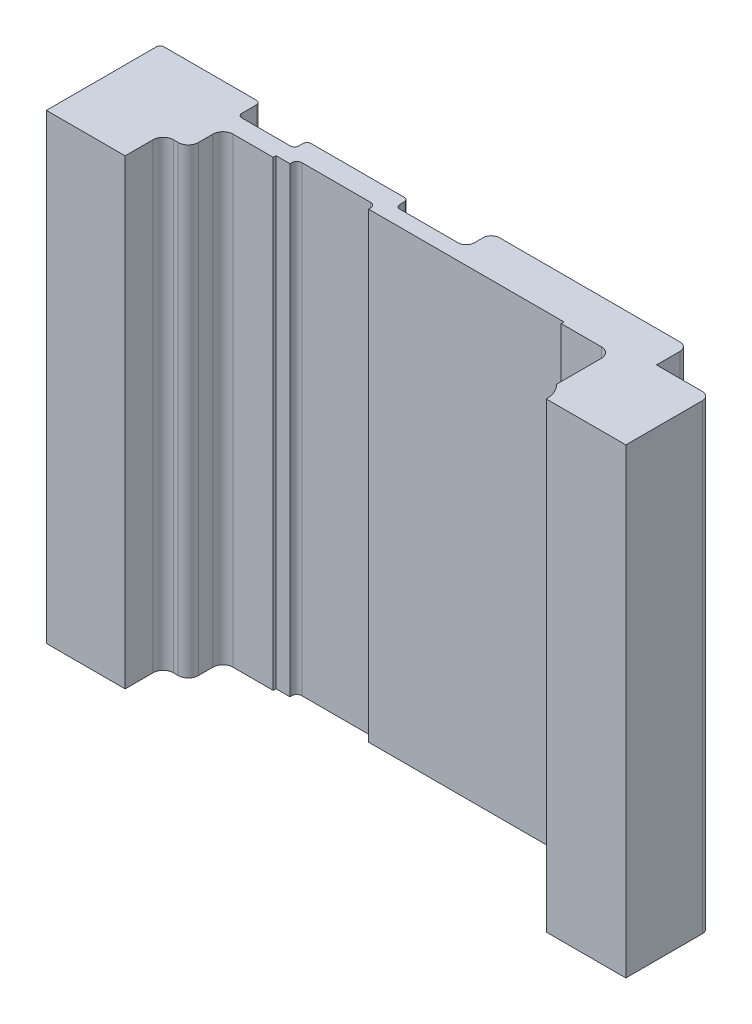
ISO-10303-21;
HEADER;
FILE_DESCRIPTION(('STEP AP214'),'2;1');
FILE_NAME('part.step','',(''),(''),'','','');
FILE_SCHEMA(('AUTOMOTIVE_DESIGN { 1 0 10303 214 1 1 1 1 }'));
ENDSEC;
DATA;
#1=APPLICATION_CONTEXT('core data for automotive mechanical design processes');
#2=APPLICATION_PROTOCOL_DEFINITION('international standard','automotive_design',2000,#1);
#3=PRODUCT_CONTEXT('',#1,'mechanical');
#4=PRODUCT('Part','Part','',(#3));
#5=PRODUCT_RELATED_PRODUCT_CATEGORY('part','',(#4));
#6=PRODUCT_DEFINITION_FORMATION('','',#4);
#7=PRODUCT_DEFINITION_CONTEXT('part definition',#1,'design');
#8=PRODUCT_DEFINITION('design','',#6,#7);
#9=PRODUCT_DEFINITION_SHAPE('','',#8);
#10=(LENGTH_UNIT() NAMED_UNIT(*) SI_UNIT(.MILLI.,.METRE.));
#11=(NAMED_UNIT(*) PLANE_ANGLE_UNIT() SI_UNIT($,.RADIAN.));
#12=(NAMED_UNIT(*) SI_UNIT($,.STERADIAN.) SOLID_ANGLE_UNIT());
#13=UNCERTAINTY_MEASURE_WITH_UNIT(LENGTH_MEASURE(1.E-05),#10,'distance_accuracy_value','');
#14=(GEOMETRIC_REPRESENTATION_CONTEXT(3) GLOBAL_UNCERTAINTY_ASSIGNED_CONTEXT((#13)) GLOBAL_UNIT_ASSIGNED_CONTEXT((#10,
#11,#12)) REPRESENTATION_CONTEXT('',''));
#15=CARTESIAN_POINT('',(0.,0.,0.));
#16=DIRECTION('',(0.,0.,1.));
#17=DIRECTION('',(1.,0.,0.));
#18=AXIS2_PLACEMENT_3D('',#15,#16,#17);
#19=CARTESIAN_POINT('',(46.0756,-165.055575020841,-1.1644034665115E-08));
#20=DIRECTION('',(0.,-7.05461458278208E-11,1.));
#21=DIRECTION('',(0.,-1.,-7.05461458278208E-11));
#22=AXIS2_PLACEMENT_3D('',#19,#20,#21);
#23=PLANE('',#22);
#24=DIRECTION('',(1.,0.,0.));
#25=VECTOR('',#24,1.);
#26=CARTESIAN_POINT('',(46.0756,3.175,2.23984013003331E-10));
#27=LINE('',#26,#25);
#28=CARTESIAN_POINT('',(124.459999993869,3.175,2.23984015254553E-10));
#29=VERTEX_POINT('',#28);
#30=CARTESIAN_POINT('',(136.9314,3.175,2.23984013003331E-10));
#31=VERTEX_POINT('',#30);
#32=EDGE_CURVE('E453',#29,#31,#27,.T.);
#33=ORIENTED_EDGE('',*,*,#32,.F.);
#34=DIRECTION('',(0.,1.,7.05461458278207E-11));
#35=VECTOR('',#34,1.);
#36=CARTESIAN_POINT('',(124.46,-52.7424995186,-3.72078006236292E-09));
#37=LINE('',#36,#35);
#38=CARTESIAN_POINT('',(124.46,-69.215,-4.88285148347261E-09));
#39=VERTEX_POINT('',#38);
#40=EDGE_CURVE('E392',#29,#39,#37,.F.);
#41=ORIENTED_EDGE('',*,*,#40,.T.);
#42=DIRECTION('',(-1.,0.,0.));
#43=VECTOR('',#42,1.);
#44=CARTESIAN_POINT('',(46.0756,-69.215,-4.88285148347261E-09));
#45=LINE('',#44,#43);
#46=CARTESIAN_POINT('',(136.9314,-69.215,-4.88285148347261E-09));
#47=VERTEX_POINT('',#46);
#48=EDGE_CURVE('E583',#47,#39,#45,.T.);
#49=ORIENTED_EDGE('',*,*,#48,.F.);
#50=DIRECTION('',(0.,1.,7.05461458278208E-11));
#51=VECTOR('',#50,1.);
#52=CARTESIAN_POINT('',(136.9314,-165.055575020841,-1.1644034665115E-08));
#53=LINE('',#52,#51);
#54=EDGE_CURVE('E579',#47,#31,#53,.T.);
#55=ORIENTED_EDGE('',*,*,#54,.T.);
#56=EDGE_LOOP('',(#33,#41,#49,#55));
#57=FACE_BOUND('',#56,.T.);
#58=ADVANCED_FACE('F16',(#57),#23,.T.);
#59=CARTESIAN_POINT('',(46.0756,-165.055575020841,-1.1644034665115E-08));
#60=DIRECTION('',(-1.,0.,0.));
#61=DIRECTION('',(0.,-1.,0.));
#62=AXIS2_PLACEMENT_3D('',#59,#60,#61);
#63=PLANE('',#62);
#64=DIRECTION('',(0.,7.0543744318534E-11,-1.));
#65=VECTOR('',#64,1.);
#66=CARTESIAN_POINT('',(46.0756,-69.215,-4.88308164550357E-09));
#67=LINE('',#66,#65);
#68=CARTESIAN_POINT('',(46.0756,-69.215,-4.88285148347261E-09));
#69=VERTEX_POINT('',#68);
#70=CARTESIAN_POINT('',(46.0756,-69.2149999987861,-17.2085000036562));
#71=VERTEX_POINT('',#70);
#72=EDGE_CURVE('E460',#69,#71,#67,.T.);
#73=ORIENTED_EDGE('',*,*,#72,.F.);
#74=DIRECTION('',(0.,1.,7.05461458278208E-11));
#75=VECTOR('',#74,1.);
#76=CARTESIAN_POINT('',(46.0756,-165.055575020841,-1.1644034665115E-08));
#77=LINE('',#76,#75);
#78=CARTESIAN_POINT('',(46.0756,3.175,2.23984013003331E-10));
#79=VERTEX_POINT('',#78);
#80=EDGE_CURVE('E531',#69,#79,#77,.T.);
#81=ORIENTED_EDGE('',*,*,#80,.T.);
#82=DIRECTION('',(0.,-7.05461438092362E-11,1.));
#83=VECTOR('',#82,1.);
#84=CARTESIAN_POINT('',(46.0756,3.175,2.23984013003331E-10));
#85=LINE('',#84,#83);
#86=CARTESIAN_POINT('',(46.0756,3.17500000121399,-17.2084999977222));
#87=VERTEX_POINT('',#86);
#88=EDGE_CURVE('E449',#87,#79,#85,.T.);
#89=ORIENTED_EDGE('',*,*,#88,.F.);
#90=DIRECTION('',(0.,1.,7.05461458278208E-11));
#91=VECTOR('',#90,1.);
#92=CARTESIAN_POINT('',(46.0756,-165.055575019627,-17.2085000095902));
#93=LINE('',#92,#91);
#94=EDGE_CURVE('E532',#71,#87,#93,.T.);
#95=ORIENTED_EDGE('',*,*,#94,.F.);
#96=EDGE_LOOP('',(#73,#81,#89,#95));
#97=FACE_BOUND('',#96,.T.);
#98=ADVANCED_FACE('F18',(#97),#63,.T.);
#99=CARTESIAN_POINT('',(46.7106,-165.055575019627,-17.2085000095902));
#100=DIRECTION('',(0.,1.,7.05461458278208E-11));
#101=DIRECTION('',(0.,-7.05461458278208E-11,1.));
#102=AXIS2_PLACEMENT_3D('',#99,#100,#101);
#103=CYLINDRICAL_SURFACE('',#102,0.635);
#104=CARTESIAN_POINT('',(46.7106,-69.2149999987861,-17.208500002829));
#105=DIRECTION('',(0.,1.,7.0543744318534E-11));
#106=DIRECTION('',(0.,-7.0543744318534E-11,1.));
#107=AXIS2_PLACEMENT_3D('',#104,#105,#106);
#108=CIRCLE('',#107,0.635);
#109=CARTESIAN_POINT('',(46.7106,-69.2149999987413,-17.843500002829));
#110=VERTEX_POINT('',#109);
#111=EDGE_CURVE('E653',#71,#110,#108,.F.);
#112=ORIENTED_EDGE('',*,*,#111,.F.);
#113=ORIENTED_EDGE('',*,*,#94,.T.);
#114=CARTESIAN_POINT('',(46.7106,3.17500000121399,-17.2084999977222));
#115=DIRECTION('',(0.,1.,7.05461458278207E-11));
#116=DIRECTION('',(0.,7.05461458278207E-11,-1.));
#117=AXIS2_PLACEMENT_3D('',#114,#115,#116);
#118=CIRCLE('',#117,0.635);
#119=CARTESIAN_POINT('',(46.7106,3.17500000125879,-17.8434999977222));
#120=VERTEX_POINT('',#119);
#121=EDGE_CURVE('E529',#120,#87,#118,.T.);
#122=ORIENTED_EDGE('',*,*,#121,.F.);
#123=DIRECTION('',(0.,1.,7.05461458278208E-11));
#124=VECTOR('',#123,1.);
#125=CARTESIAN_POINT('',(46.7106,-165.055575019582,-17.8435000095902));
#126=LINE('',#125,#124);
#127=EDGE_CURVE('E535',#110,#120,#126,.T.);
#128=ORIENTED_EDGE('',*,*,#127,.F.);
#129=EDGE_LOOP('',(#112,#113,#122,#128));
#130=FACE_BOUND('',#129,.T.);
#131=ADVANCED_FACE('F709',(#130),#103,.T.);
#132=CARTESIAN_POINT('',(46.7106,-165.055575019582,-17.8435000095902));
#133=DIRECTION('',(0.,7.05461458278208E-11,-1.));
#134=DIRECTION('',(0.,1.,7.05461458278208E-11));
#135=AXIS2_PLACEMENT_3D('',#132,#133,#134);
#136=PLANE('',#135);
#137=DIRECTION('',(1.,0.,0.));
#138=VECTOR('',#137,1.);
#139=CARTESIAN_POINT('',(46.7106,-69.2149999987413,-17.843500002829));
#140=LINE('',#139,#138);
#141=CARTESIAN_POINT('',(61.1632000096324,-69.2149999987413,-17.843500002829));
#142=VERTEX_POINT('',#141);
#143=EDGE_CURVE('E655',#110,#142,#140,.T.);
#144=ORIENTED_EDGE('',*,*,#143,.F.);
#145=ORIENTED_EDGE('',*,*,#127,.T.);
#146=DIRECTION('',(-1.,0.,0.));
#147=VECTOR('',#146,1.);
#148=CARTESIAN_POINT('',(46.7106,3.17500000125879,-17.8434999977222));
#149=LINE('',#148,#147);
#150=CARTESIAN_POINT('',(61.1632000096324,3.17500000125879,-17.8434999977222));
#151=VERTEX_POINT('',#150);
#152=EDGE_CURVE('E526',#151,#120,#149,.T.);
#153=ORIENTED_EDGE('',*,*,#152,.F.);
#154=DIRECTION('',(0.,1.,7.05461458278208E-11));
#155=VECTOR('',#154,1.);
#156=CARTESIAN_POINT('',(61.1632000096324,-165.055575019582,-17.8435000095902));
#157=LINE('',#156,#155);
#158=EDGE_CURVE('E537',#142,#151,#157,.T.);
#159=ORIENTED_EDGE('',*,*,#158,.F.);
#160=EDGE_LOOP('',(#144,#145,#153,#159));
#161=FACE_BOUND('',#160,.T.);
#162=ADVANCED_FACE('F802',(#161),#136,.T.);
#163=CARTESIAN_POINT('',(61.1632000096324,-165.055575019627,-17.2085000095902));
#164=DIRECTION('',(0.,1.,7.05461458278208E-11));
#165=DIRECTION('',(0.,-7.05461458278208E-11,1.));
#166=AXIS2_PLACEMENT_3D('',#163,#164,#165);
#167=CYLINDRICAL_SURFACE('',#166,0.635);
#168=CARTESIAN_POINT('',(61.1632000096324,-69.2149999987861,-17.208500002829));
#169=DIRECTION('',(0.,1.,7.0543744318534E-11));
#170=DIRECTION('',(0.,-7.0543744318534E-11,1.));
#171=AXIS2_PLACEMENT_3D('',#168,#169,#170);
#172=CIRCLE('',#171,0.635);
#173=CARTESIAN_POINT('',(61.7982000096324,-69.2149999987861,-17.2085000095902));
#174=VERTEX_POINT('',#173);
#175=EDGE_CURVE('E657',#142,#174,#172,.F.);
#176=ORIENTED_EDGE('',*,*,#175,.F.);
#177=ORIENTED_EDGE('',*,*,#158,.T.);
#178=CARTESIAN_POINT('',(61.1632000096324,3.17500000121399,-17.2084999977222));
#179=DIRECTION('',(0.,1.,7.05461458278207E-11));
#180=DIRECTION('',(0.,-7.05461458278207E-11,1.));
#181=AXIS2_PLACEMENT_3D('',#178,#179,#180);
#182=CIRCLE('',#181,0.635);
#183=CARTESIAN_POINT('',(61.7982000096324,3.17500000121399,-17.2084999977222));
#184=VERTEX_POINT('',#183);
#185=EDGE_CURVE('E523',#184,#151,#182,.T.);
#186=ORIENTED_EDGE('',*,*,#185,.F.);
#187=DIRECTION('',(0.,1.,7.05461458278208E-11));
#188=VECTOR('',#187,1.);
#189=CARTESIAN_POINT('',(61.7982000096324,-165.055575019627,-17.2085000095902));
#190=LINE('',#189,#188);
#191=EDGE_CURVE('E539',#174,#184,#190,.T.);
#192=ORIENTED_EDGE('',*,*,#191,.F.);
#193=EDGE_LOOP('',(#176,#177,#186,#192));
#194=FACE_BOUND('',#193,.T.);
#195=ADVANCED_FACE('F798',(#194),#167,.T.);
#196=CARTESIAN_POINT('',(61.7982000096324,-165.055575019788,-14.9225000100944));
#197=DIRECTION('',(1.,0.,0.));
#198=DIRECTION('',(0.,0.,-1.));
#199=AXIS2_PLACEMENT_3D('',#196,#197,#198);
#200=PLANE('',#199);
#201=DIRECTION('',(0.,-7.0543744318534E-11,1.));
#202=VECTOR('',#201,1.);
#203=CARTESIAN_POINT('',(61.7982000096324,-69.2149999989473,-14.9225000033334));
#204=LINE('',#203,#202);
#205=CARTESIAN_POINT('',(61.7982000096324,-69.2149999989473,-14.9225000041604));
#206=VERTEX_POINT('',#205);
#207=EDGE_CURVE('E661',#174,#206,#204,.T.);
#208=ORIENTED_EDGE('',*,*,#207,.F.);
#209=ORIENTED_EDGE('',*,*,#191,.T.);
#210=DIRECTION('',(0.,7.05461802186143E-11,-1.));
#211=VECTOR('',#210,1.);
#212=CARTESIAN_POINT('',(61.7982000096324,3.17500000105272,-14.9224999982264));
#213=LINE('',#212,#211);
#214=CARTESIAN_POINT('',(61.7982000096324,3.17500000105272,-14.9224999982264));
#215=VERTEX_POINT('',#214);
#216=EDGE_CURVE('E520',#215,#184,#213,.T.);
#217=ORIENTED_EDGE('',*,*,#216,.F.);
#218=DIRECTION('',(0.,1.,7.05461458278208E-11));
#219=VECTOR('',#218,1.);
#220=CARTESIAN_POINT('',(61.7982000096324,-165.055575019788,-14.9225000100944));
#221=LINE('',#220,#219);
#222=EDGE_CURVE('E541',#206,#215,#221,.T.);
#223=ORIENTED_EDGE('',*,*,#222,.F.);
#224=EDGE_LOOP('',(#208,#209,#217,#223));
#225=FACE_BOUND('',#224,.T.);
#226=ADVANCED_FACE('F794',(#225),#200,.T.);
#227=CARTESIAN_POINT('',(62.4332000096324,-165.055575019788,-14.9225000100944));
#228=DIRECTION('',(0.,1.,7.05461458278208E-11));
#229=DIRECTION('',(0.,-7.05461458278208E-11,1.));
#230=AXIS2_PLACEMENT_3D('',#227,#228,#229);
#231=CYLINDRICAL_SURFACE('',#230,0.635);
#232=CARTESIAN_POINT('',(62.4332000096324,-69.2149999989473,-14.9225000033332));
#233=DIRECTION('',(0.,1.,7.0543744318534E-11));
#234=DIRECTION('',(0.,-7.0543744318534E-11,1.));
#235=AXIS2_PLACEMENT_3D('',#232,#233,#234);
#236=CIRCLE('',#235,0.635);
#237=CARTESIAN_POINT('',(62.4332000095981,-69.2149999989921,-14.2875000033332));
#238=VERTEX_POINT('',#237);
#239=EDGE_CURVE('E663',#206,#238,#236,.T.);
#240=ORIENTED_EDGE('',*,*,#239,.F.);
#241=ORIENTED_EDGE('',*,*,#222,.T.);
#242=CARTESIAN_POINT('',(62.4332000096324,3.17500000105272,-14.9224999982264));
#243=DIRECTION('',(0.,-1.,-7.05461458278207E-11));
#244=DIRECTION('',(0.,-7.05461458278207E-11,1.));
#245=AXIS2_PLACEMENT_3D('',#242,#243,#244);
#246=CIRCLE('',#245,0.635);
#247=CARTESIAN_POINT('',(62.4332000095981,3.17500000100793,-14.2874999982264));
#248=VERTEX_POINT('',#247);
#249=EDGE_CURVE('E517',#248,#215,#246,.T.);
#250=ORIENTED_EDGE('',*,*,#249,.F.);
#251=DIRECTION('',(0.,1.,7.05461458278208E-11));
#252=VECTOR('',#251,1.);
#253=CARTESIAN_POINT('',(62.4332000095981,-165.055575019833,-14.2875000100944));
#254=LINE('',#253,#252);
#255=EDGE_CURVE('E543',#238,#248,#254,.T.);
#256=ORIENTED_EDGE('',*,*,#255,.F.);
#257=EDGE_LOOP('',(#240,#241,#250,#256));
#258=FACE_BOUND('',#257,.T.);
#259=ADVANCED_FACE('F790',(#258),#231,.F.);
#260=CARTESIAN_POINT('',(62.4332000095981,-165.055575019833,-14.2875000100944));
#261=DIRECTION('',(5.40122773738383E-11,7.05461458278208E-11,-1.));
#262=DIRECTION('',(0.,1.,7.05461458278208E-11));
#263=AXIS2_PLACEMENT_3D('',#260,#261,#262);
#264=PLANE('',#263);
#265=DIRECTION('',(1.,0.,5.40122773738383E-11));
#266=VECTOR('',#265,1.);
#267=CARTESIAN_POINT('',(62.4332000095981,-69.2149999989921,-14.2875000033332));
#268=LINE('',#267,#266);
#269=CARTESIAN_POINT('',(70.0531999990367,-69.2149999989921,-14.2875000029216));
#270=VERTEX_POINT('',#269);
#271=EDGE_CURVE('E665',#238,#270,#268,.T.);
#272=ORIENTED_EDGE('',*,*,#271,.F.);
#273=ORIENTED_EDGE('',*,*,#255,.T.);
#274=DIRECTION('',(-1.,0.,-5.40122773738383E-11));
#275=VECTOR('',#274,1.);
#276=CARTESIAN_POINT('',(62.4332000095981,3.17500000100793,-14.2874999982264));
#277=LINE('',#276,#275);
#278=CARTESIAN_POINT('',(70.0531999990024,3.17500000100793,-14.2874999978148));
#279=VERTEX_POINT('',#278);
#280=EDGE_CURVE('E514',#279,#248,#277,.T.);
#281=ORIENTED_EDGE('',*,*,#280,.F.);
#282=DIRECTION('',(0.,1.,7.05461458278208E-11));
#283=VECTOR('',#282,1.);
#284=CARTESIAN_POINT('',(70.0531999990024,-165.055575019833,-14.2875000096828));
#285=LINE('',#284,#283);
#286=EDGE_CURVE('E545',#270,#279,#285,.T.);
#287=ORIENTED_EDGE('',*,*,#286,.F.);
#288=EDGE_LOOP('',(#272,#273,#281,#287));
#289=FACE_BOUND('',#288,.T.);
#290=ADVANCED_FACE('F786',(#289),#264,.T.);
#291=CARTESIAN_POINT('',(70.0531999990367,-165.055575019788,-14.9225000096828));
#292=DIRECTION('',(0.,1.,7.05461458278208E-11));
#293=DIRECTION('',(0.,-7.05461458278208E-11,1.));
#294=AXIS2_PLACEMENT_3D('',#291,#292,#293);
#295=CYLINDRICAL_SURFACE('',#294,0.635);
#296=CARTESIAN_POINT('',(70.0531999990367,-69.2149999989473,-14.9225000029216));
#297=DIRECTION('',(0.,1.,7.0543744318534E-11));
#298=DIRECTION('',(0.,-7.0543744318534E-11,1.));
#299=AXIS2_PLACEMENT_3D('',#296,#297,#298);
#300=CIRCLE('',#299,0.635);
#301=CARTESIAN_POINT('',(70.6881999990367,-69.2149999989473,-14.9224999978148));
#302=VERTEX_POINT('',#301);
#303=EDGE_CURVE('E667',#270,#302,#300,.T.);
#304=ORIENTED_EDGE('',*,*,#303,.F.);
#305=ORIENTED_EDGE('',*,*,#286,.T.);
#306=CARTESIAN_POINT('',(70.0531999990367,3.17500000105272,-14.9224999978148));
#307=DIRECTION('',(0.,-1.,-7.05461458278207E-11));
#308=DIRECTION('',(0.,7.05461458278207E-11,-1.));
#309=AXIS2_PLACEMENT_3D('',#306,#307,#308);
#310=CIRCLE('',#309,0.635);
#311=CARTESIAN_POINT('',(70.6881999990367,3.17500000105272,-14.9224999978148));
#312=VERTEX_POINT('',#311);
#313=EDGE_CURVE('E511',#312,#279,#310,.T.);
#314=ORIENTED_EDGE('',*,*,#313,.F.);
#315=DIRECTION('',(0.,1.,7.05461458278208E-11));
#316=VECTOR('',#315,1.);
#317=CARTESIAN_POINT('',(70.6881999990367,-165.055575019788,-14.9225000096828));
#318=LINE('',#317,#316);
#319=EDGE_CURVE('E547',#302,#312,#318,.T.);
#320=ORIENTED_EDGE('',*,*,#319,.F.);
#321=EDGE_LOOP('',(#304,#305,#314,#320));
#322=FACE_BOUND('',#321,.T.);
#323=ADVANCED_FACE('F782',(#322),#295,.F.);
#324=CARTESIAN_POINT('',(70.6881999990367,-165.05557501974,-15.6083000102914));
#325=DIRECTION('',(-1.,0.,0.));
#326=DIRECTION('',(0.,-1.,0.));
#327=AXIS2_PLACEMENT_3D('',#324,#325,#326);
#328=PLANE('',#327);
#329=DIRECTION('',(0.,7.0543744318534E-11,-1.));
#330=VECTOR('',#329,1.);
#331=CARTESIAN_POINT('',(70.6881999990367,-69.2149999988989,-15.6083000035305));
#332=LINE('',#331,#330);
#333=CARTESIAN_POINT('',(70.6881999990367,-69.2149999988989,-15.6083000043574));
#334=VERTEX_POINT('',#333);
#335=EDGE_CURVE('E669',#302,#334,#332,.T.);
#336=ORIENTED_EDGE('',*,*,#335,.F.);
#337=ORIENTED_EDGE('',*,*,#319,.T.);
#338=DIRECTION('',(0.,-7.05461801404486E-11,1.));
#339=VECTOR('',#338,1.);
#340=CARTESIAN_POINT('',(70.6881999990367,3.17500000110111,-15.6082999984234));
#341=LINE('',#340,#339);
#342=CARTESIAN_POINT('',(70.6881999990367,3.17500000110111,-15.6082999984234));
#343=VERTEX_POINT('',#342);
#344=EDGE_CURVE('E508',#343,#312,#341,.T.);
#345=ORIENTED_EDGE('',*,*,#344,.F.);
#346=DIRECTION('',(0.,1.,7.05461458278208E-11));
#347=VECTOR('',#346,1.);
#348=CARTESIAN_POINT('',(70.6881999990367,-165.05557501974,-15.6083000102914));
#349=LINE('',#348,#347);
#350=EDGE_CURVE('E549',#334,#343,#349,.T.);
#351=ORIENTED_EDGE('',*,*,#350,.F.);
#352=EDGE_LOOP('',(#336,#337,#345,#351));
#353=FACE_BOUND('',#352,.T.);
#354=ADVANCED_FACE('F778',(#353),#328,.T.);
#355=CARTESIAN_POINT('',(71.3231999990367,-165.05557501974,-15.6083000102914));
#356=DIRECTION('',(0.,1.,7.05461458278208E-11));
#357=DIRECTION('',(0.,-7.05461458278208E-11,1.));
#358=AXIS2_PLACEMENT_3D('',#355,#356,#357);
#359=CYLINDRICAL_SURFACE('',#358,0.635);
#360=CARTESIAN_POINT('',(71.3231999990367,-69.2149999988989,-15.6083000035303));
#361=DIRECTION('',(0.,1.,7.0543744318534E-11));
#362=DIRECTION('',(0.,-7.0543744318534E-11,1.));
#363=AXIS2_PLACEMENT_3D('',#360,#361,#362);
#364=CIRCLE('',#363,0.635);
#365=CARTESIAN_POINT('',(71.3231999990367,-69.2149999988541,-16.2433000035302));
#366=VERTEX_POINT('',#365);
#367=EDGE_CURVE('E671',#334,#366,#364,.F.);
#368=ORIENTED_EDGE('',*,*,#367,.F.);
#369=ORIENTED_EDGE('',*,*,#350,.T.);
#370=CARTESIAN_POINT('',(71.3231999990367,3.17500000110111,-15.6082999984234));
#371=DIRECTION('',(0.,1.,7.05461458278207E-11));
#372=DIRECTION('',(0.,7.05461458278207E-11,-1.));
#373=AXIS2_PLACEMENT_3D('',#370,#371,#372);
#374=CIRCLE('',#373,0.635);
#375=CARTESIAN_POINT('',(71.3231999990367,3.1750000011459,-16.2432999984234));
#376=VERTEX_POINT('',#375);
#377=EDGE_CURVE('E505',#376,#343,#374,.T.);
#378=ORIENTED_EDGE('',*,*,#377,.F.);
#379=DIRECTION('',(0.,1.,7.05461458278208E-11));
#380=VECTOR('',#379,1.);
#381=CARTESIAN_POINT('',(71.3231999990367,-165.055575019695,-16.2433000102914));
#382=LINE('',#381,#380);
#383=EDGE_CURVE('E551',#366,#376,#382,.T.);
#384=ORIENTED_EDGE('',*,*,#383,.F.);
#385=EDGE_LOOP('',(#368,#369,#378,#384));
#386=FACE_BOUND('',#385,.T.);
#387=ADVANCED_FACE('F774',(#386),#359,.T.);
#388=CARTESIAN_POINT('',(71.3231999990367,-165.055575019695,-16.2433000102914));
#389=DIRECTION('',(0.,7.05461458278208E-11,-1.));
#390=DIRECTION('',(0.,1.,7.05461458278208E-11));
#391=AXIS2_PLACEMENT_3D('',#388,#389,#390);
#392=PLANE('',#391);
#393=DIRECTION('',(1.,0.,0.));
#394=VECTOR('',#393,1.);
#395=CARTESIAN_POINT('',(71.3231999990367,-69.2149999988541,-16.2433000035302));
#396=LINE('',#395,#394);
#397=CARTESIAN_POINT('',(85.9281999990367,-69.2149999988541,-16.2433000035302));
#398=VERTEX_POINT('',#397);
#399=EDGE_CURVE('E673',#366,#398,#396,.T.);
#400=ORIENTED_EDGE('',*,*,#399,.F.);
#401=ORIENTED_EDGE('',*,*,#383,.T.);
#402=DIRECTION('',(-1.,0.,0.));
#403=VECTOR('',#402,1.);
#404=CARTESIAN_POINT('',(71.3231999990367,3.1750000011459,-16.2432999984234));
#405=LINE('',#404,#403);
#406=CARTESIAN_POINT('',(85.9281999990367,3.1750000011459,-16.2432999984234));
#407=VERTEX_POINT('',#406);
#408=EDGE_CURVE('E502',#407,#376,#405,.T.);
#409=ORIENTED_EDGE('',*,*,#408,.F.);
#410=DIRECTION('',(0.,1.,7.05461458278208E-11));
#411=VECTOR('',#410,1.);
#412=CARTESIAN_POINT('',(85.9281999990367,-165.055575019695,-16.2433000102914));
#413=LINE('',#412,#411);
#414=EDGE_CURVE('E553',#398,#407,#413,.T.);
#415=ORIENTED_EDGE('',*,*,#414,.F.);
#416=EDGE_LOOP('',(#400,#401,#409,#415));
#417=FACE_BOUND('',#416,.T.);
#418=ADVANCED_FACE('F770',(#417),#392,.T.);
#419=CARTESIAN_POINT('',(85.9281999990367,-165.05557501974,-15.6083000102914));
#420=DIRECTION('',(0.,1.,7.05461458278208E-11));
#421=DIRECTION('',(0.,-7.05461458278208E-11,1.));
#422=AXIS2_PLACEMENT_3D('',#419,#420,#421);
#423=CYLINDRICAL_SURFACE('',#422,0.635);
#424=CARTESIAN_POINT('',(85.9281999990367,-69.2149999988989,-15.6083000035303));
#425=DIRECTION('',(0.,1.,7.0543744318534E-11));
#426=DIRECTION('',(0.,-7.0543744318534E-11,1.));
#427=AXIS2_PLACEMENT_3D('',#424,#425,#426);
#428=CIRCLE('',#427,0.635);
#429=CARTESIAN_POINT('',(86.5631999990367,-69.2149999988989,-15.6083000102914));
#430=VERTEX_POINT('',#429);
#431=EDGE_CURVE('E675',#398,#430,#428,.F.);
#432=ORIENTED_EDGE('',*,*,#431,.F.);
#433=ORIENTED_EDGE('',*,*,#414,.T.);
#434=CARTESIAN_POINT('',(85.9281999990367,3.17500000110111,-15.6082999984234));
#435=DIRECTION('',(0.,1.,7.05461458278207E-11));
#436=DIRECTION('',(0.,-7.05461458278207E-11,1.));
#437=AXIS2_PLACEMENT_3D('',#434,#435,#436);
#438=CIRCLE('',#437,0.635);
#439=CARTESIAN_POINT('',(86.5631999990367,3.17500000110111,-15.6082999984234));
#440=VERTEX_POINT('',#439);
#441=EDGE_CURVE('E499',#440,#407,#438,.T.);
#442=ORIENTED_EDGE('',*,*,#441,.F.);
#443=DIRECTION('',(0.,1.,7.05461458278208E-11));
#444=VECTOR('',#443,1.);
#445=CARTESIAN_POINT('',(86.5631999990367,-165.05557501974,-15.6083000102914));
#446=LINE('',#445,#444);
#447=EDGE_CURVE('E555',#430,#440,#446,.T.);
#448=ORIENTED_EDGE('',*,*,#447,.F.);
#449=EDGE_LOOP('',(#432,#433,#442,#448));
#450=FACE_BOUND('',#449,.T.);
#451=ADVANCED_FACE('F766',(#450),#423,.T.);
#452=CARTESIAN_POINT('',(86.5631999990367,-165.05557501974,-15.6083000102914));
#453=DIRECTION('',(1.,0.,0.));
#454=DIRECTION('',(0.,1.,0.));
#455=AXIS2_PLACEMENT_3D('',#452,#453,#454);
#456=PLANE('',#455);
#457=DIRECTION('',(0.,-7.0543744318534E-11,1.));
#458=VECTOR('',#457,1.);
#459=CARTESIAN_POINT('',(86.5631999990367,-69.2149999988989,-15.6083000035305));
#460=LINE('',#459,#458);
#461=CARTESIAN_POINT('',(86.5631999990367,-69.2149999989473,-14.9225000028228));
#462=VERTEX_POINT('',#461);
#463=EDGE_CURVE('E677',#430,#462,#460,.T.);
#464=ORIENTED_EDGE('',*,*,#463,.F.);
#465=ORIENTED_EDGE('',*,*,#447,.T.);
#466=DIRECTION('',(0.,7.05461800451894E-11,-1.));
#467=VECTOR('',#466,1.);
#468=CARTESIAN_POINT('',(86.5631999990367,3.17500000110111,-15.6082999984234));
#469=LINE('',#468,#467);
#470=CARTESIAN_POINT('',(86.5631999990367,3.17500000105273,-14.9224999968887));
#471=VERTEX_POINT('',#470);
#472=EDGE_CURVE('E496',#471,#440,#469,.T.);
#473=ORIENTED_EDGE('',*,*,#472,.F.);
#474=DIRECTION('',(0.,1.,7.05461458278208E-11));
#475=VECTOR('',#474,1.);
#476=CARTESIAN_POINT('',(86.5631999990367,-165.055575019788,-14.9225000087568));
#477=LINE('',#476,#475);
#478=EDGE_CURVE('E557',#462,#471,#477,.T.);
#479=ORIENTED_EDGE('',*,*,#478,.F.);
#480=EDGE_LOOP('',(#464,#465,#473,#479));
#481=FACE_BOUND('',#480,.T.);
#482=ADVANCED_FACE('F762',(#481),#456,.T.);
#483=CARTESIAN_POINT('',(87.1981999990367,-165.055575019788,-14.9225000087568));
#484=DIRECTION('',(0.,1.,7.05461458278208E-11));
#485=DIRECTION('',(0.,-7.05461458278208E-11,1.));
#486=AXIS2_PLACEMENT_3D('',#483,#484,#485);
#487=CYLINDRICAL_SURFACE('',#486,0.635);
#488=CARTESIAN_POINT('',(87.1981999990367,-69.2149999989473,-14.9225000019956));
#489=DIRECTION('',(0.,1.,7.0543744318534E-11));
#490=DIRECTION('',(0.,-7.0543744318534E-11,1.));
#491=AXIS2_PLACEMENT_3D('',#488,#489,#490);
#492=CIRCLE('',#491,0.635);
#493=CARTESIAN_POINT('',(87.1981999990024,-69.2149999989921,-14.2875000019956));
#494=VERTEX_POINT('',#493);
#495=EDGE_CURVE('E679',#462,#494,#492,.T.);
#496=ORIENTED_EDGE('',*,*,#495,.F.);
#497=ORIENTED_EDGE('',*,*,#478,.T.);
#498=CARTESIAN_POINT('',(87.1981999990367,3.17500000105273,-14.9224999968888));
#499=DIRECTION('',(0.,-1.,-7.05461458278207E-11));
#500=DIRECTION('',(0.,7.05461458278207E-11,-1.));
#501=AXIS2_PLACEMENT_3D('',#498,#499,#500);
#502=CIRCLE('',#501,0.635);
#503=CARTESIAN_POINT('',(87.1981999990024,3.17500000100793,-14.2874999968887));
#504=VERTEX_POINT('',#503);
#505=EDGE_CURVE('E493',#504,#471,#502,.T.);
#506=ORIENTED_EDGE('',*,*,#505,.F.);
#507=DIRECTION('',(0.,1.,7.05461458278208E-11));
#508=VECTOR('',#507,1.);
#509=CARTESIAN_POINT('',(87.1981999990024,-165.055575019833,-14.2875000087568));
#510=LINE('',#509,#508);
#511=EDGE_CURVE('E559',#494,#504,#510,.T.);
#512=ORIENTED_EDGE('',*,*,#511,.F.);
#513=EDGE_LOOP('',(#496,#497,#506,#512));
#514=FACE_BOUND('',#513,.T.);
#515=ADVANCED_FACE('F758',(#514),#487,.F.);
#516=CARTESIAN_POINT('',(87.1981999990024,-165.055575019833,-14.2875000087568));
#517=DIRECTION('',(5.40122393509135E-11,7.05461458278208E-11,-1.));
#518=DIRECTION('',(0.,1.,7.05461458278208E-11));
#519=AXIS2_PLACEMENT_3D('',#516,#517,#518);
#520=PLANE('',#519);
#521=DIRECTION('',(1.,0.,5.40122393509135E-11));
#522=VECTOR('',#521,1.);
#523=CARTESIAN_POINT('',(87.1981999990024,-69.2149999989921,-14.2875000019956));
#524=LINE('',#523,#522);
#525=CARTESIAN_POINT('',(96.3422,-69.2149999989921,-14.2875000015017));
#526=VERTEX_POINT('',#525);
#527=EDGE_CURVE('E681',#494,#526,#524,.T.);
#528=ORIENTED_EDGE('',*,*,#527,.F.);
#529=ORIENTED_EDGE('',*,*,#511,.T.);
#530=DIRECTION('',(-1.,0.,-5.40122393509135E-11));
#531=VECTOR('',#530,1.);
#532=CARTESIAN_POINT('',(87.1981999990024,3.17500000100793,-14.2874999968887));
#533=LINE('',#532,#531);
#534=CARTESIAN_POINT('',(96.3421999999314,3.17500000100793,-14.2874999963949));
#535=VERTEX_POINT('',#534);
#536=EDGE_CURVE('E490',#535,#504,#533,.T.);
#537=ORIENTED_EDGE('',*,*,#536,.F.);
#538=DIRECTION('',(0.,1.,7.05461458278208E-11));
#539=VECTOR('',#538,1.);
#540=CARTESIAN_POINT('',(96.3421999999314,-165.055575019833,-14.2875000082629));
#541=LINE('',#540,#539);
#542=EDGE_CURVE('E561',#526,#535,#541,.T.);
#543=ORIENTED_EDGE('',*,*,#542,.F.);
#544=EDGE_LOOP('',(#528,#529,#537,#543));
#545=FACE_BOUND('',#544,.T.);
#546=ADVANCED_FACE('F754',(#545),#520,.T.);
#547=CARTESIAN_POINT('',(96.3422,-165.055575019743,-15.5575000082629));
#548=DIRECTION('',(0.,1.,7.05461458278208E-11));
#549=DIRECTION('',(0.,-7.05461458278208E-11,1.));
#550=AXIS2_PLACEMENT_3D('',#547,#548,#549);
#551=CYLINDRICAL_SURFACE('',#550,1.27);
#552=CARTESIAN_POINT('',(96.3422,-69.2149999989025,-15.5575000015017));
#553=DIRECTION('',(0.,1.,7.0543744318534E-11));
#554=DIRECTION('',(0.,-7.0543744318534E-11,1.));
#555=AXIS2_PLACEMENT_3D('',#552,#553,#554);
#556=CIRCLE('',#555,1.27);
#557=CARTESIAN_POINT('',(97.6122,-69.2149999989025,-15.5574999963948));
#558=VERTEX_POINT('',#557);
#559=EDGE_CURVE('E683',#526,#558,#556,.T.);
#560=ORIENTED_EDGE('',*,*,#559,.F.);
#561=ORIENTED_EDGE('',*,*,#542,.T.);
#562=CARTESIAN_POINT('',(96.3422,3.17500000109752,-15.5574999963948));
#563=DIRECTION('',(0.,-1.,-7.05461458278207E-11));
#564=DIRECTION('',(0.,7.05461458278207E-11,-1.));
#565=AXIS2_PLACEMENT_3D('',#562,#563,#564);
#566=CIRCLE('',#565,1.27);
#567=CARTESIAN_POINT('',(97.6122,3.17500000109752,-15.5574999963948));
#568=VERTEX_POINT('',#567);
#569=EDGE_CURVE('E487',#568,#535,#566,.T.);
#570=ORIENTED_EDGE('',*,*,#569,.F.);
#571=DIRECTION('',(0.,1.,7.05461458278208E-11));
#572=VECTOR('',#571,1.);
#573=CARTESIAN_POINT('',(97.6122,-165.055575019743,-15.5575000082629));
#574=LINE('',#573,#572);
#575=EDGE_CURVE('E563',#558,#568,#574,.T.);
#576=ORIENTED_EDGE('',*,*,#575,.F.);
#577=EDGE_LOOP('',(#560,#561,#570,#576));
#578=FACE_BOUND('',#577,.T.);
#579=ADVANCED_FACE('F750',(#578),#551,.F.);
#580=CARTESIAN_POINT('',(97.6122,-165.055575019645,-16.9545000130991));
#581=DIRECTION('',(-1.,0.,0.));
#582=DIRECTION('',(0.,-1.,0.));
#583=AXIS2_PLACEMENT_3D('',#580,#581,#582);
#584=PLANE('',#583);
#585=DIRECTION('',(0.,7.0543744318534E-11,-1.));
#586=VECTOR('',#585,1.);
#587=CARTESIAN_POINT('',(97.6122,-69.214999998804,-16.9545000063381));
#588=LINE('',#587,#586);
#589=CARTESIAN_POINT('',(97.6122,-69.214999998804,-16.9545000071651));
#590=VERTEX_POINT('',#589);
#591=EDGE_CURVE('E685',#558,#590,#588,.T.);
#592=ORIENTED_EDGE('',*,*,#591,.F.);
#593=ORIENTED_EDGE('',*,*,#575,.T.);
#594=DIRECTION('',(0.,-7.05459385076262E-11,1.));
#595=VECTOR('',#594,1.);
#596=CARTESIAN_POINT('',(97.6122,3.17500000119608,-16.9545000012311));
#597=LINE('',#596,#595);
#598=CARTESIAN_POINT('',(97.6122,3.17500000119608,-16.9545000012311));
#599=VERTEX_POINT('',#598);
#600=EDGE_CURVE('E484',#599,#568,#597,.T.);
#601=ORIENTED_EDGE('',*,*,#600,.F.);
#602=DIRECTION('',(0.,1.,7.05461458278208E-11));
#603=VECTOR('',#602,1.);
#604=CARTESIAN_POINT('',(97.6122,-165.055575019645,-16.9545000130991));
#605=LINE('',#604,#603);
#606=EDGE_CURVE('E565',#590,#599,#605,.T.);
#607=ORIENTED_EDGE('',*,*,#606,.F.);
#608=EDGE_LOOP('',(#592,#593,#601,#607));
#609=FACE_BOUND('',#608,.T.);
#610=ADVANCED_FACE('F746',(#609),#584,.T.);
#611=CARTESIAN_POINT('',(98.8822,-165.055575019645,-16.9545000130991));
#612=DIRECTION('',(0.,1.,7.05461458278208E-11));
#613=DIRECTION('',(0.,-7.05461458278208E-11,1.));
#614=AXIS2_PLACEMENT_3D('',#611,#612,#613);
#615=CYLINDRICAL_SURFACE('',#614,1.27);
#616=CARTESIAN_POINT('',(98.8822,-69.214999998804,-16.9545000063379));
#617=DIRECTION('',(0.,1.,7.0543744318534E-11));
#618=DIRECTION('',(0.,-7.0543744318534E-11,1.));
#619=AXIS2_PLACEMENT_3D('',#616,#617,#618);
#620=CIRCLE('',#619,1.27);
#621=CARTESIAN_POINT('',(98.8822,-69.2149999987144,-18.2245000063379));
#622=VERTEX_POINT('',#621);
#623=EDGE_CURVE('E687',#590,#622,#620,.F.);
#624=ORIENTED_EDGE('',*,*,#623,.F.);
#625=ORIENTED_EDGE('',*,*,#606,.T.);
#626=CARTESIAN_POINT('',(98.8822,3.17500000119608,-16.9545000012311));
#627=DIRECTION('',(0.,1.,7.05461458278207E-11));
#628=DIRECTION('',(0.,-7.05461458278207E-11,1.));
#629=AXIS2_PLACEMENT_3D('',#626,#627,#628);
#630=CIRCLE('',#629,1.27);
#631=CARTESIAN_POINT('',(98.8822,3.17500000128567,-18.224500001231));
#632=VERTEX_POINT('',#631);
#633=EDGE_CURVE('E481',#632,#599,#630,.T.);
#634=ORIENTED_EDGE('',*,*,#633,.F.);
#635=DIRECTION('',(0.,1.,7.05461458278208E-11));
#636=VECTOR('',#635,1.);
#637=CARTESIAN_POINT('',(98.8822,-165.055575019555,-18.224500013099));
#638=LINE('',#637,#636);
#639=EDGE_CURVE('E567',#622,#632,#638,.T.);
#640=ORIENTED_EDGE('',*,*,#639,.F.);
#641=EDGE_LOOP('',(#624,#625,#634,#640));
#642=FACE_BOUND('',#641,.T.);
#643=ADVANCED_FACE('F742',(#642),#615,.T.);
#644=CARTESIAN_POINT('',(98.8822,-165.055575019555,-18.224500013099));
#645=DIRECTION('',(0.,7.05461458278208E-11,-1.));
#646=DIRECTION('',(0.,1.,7.05461458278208E-11));
#647=AXIS2_PLACEMENT_3D('',#644,#645,#646);
#648=PLANE('',#647);
#649=DIRECTION('',(1.,0.,0.));
#650=VECTOR('',#649,1.);
#651=CARTESIAN_POINT('',(98.8822,-69.2149999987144,-18.2245000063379));
#652=LINE('',#651,#650);
#653=CARTESIAN_POINT('',(127.203199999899,-69.2149999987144,-18.2245000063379));
#654=VERTEX_POINT('',#653);
#655=EDGE_CURVE('E689',#622,#654,#652,.T.);
#656=ORIENTED_EDGE('',*,*,#655,.F.);
#657=ORIENTED_EDGE('',*,*,#639,.T.);
#658=DIRECTION('',(-1.,0.,0.));
#659=VECTOR('',#658,1.);
#660=CARTESIAN_POINT('',(98.8822,3.17500000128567,-18.224500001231));
#661=LINE('',#660,#659);
#662=CARTESIAN_POINT('',(127.203199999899,3.17500000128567,-18.224500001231));
#663=VERTEX_POINT('',#662);
#664=EDGE_CURVE('E478',#663,#632,#661,.T.);
#665=ORIENTED_EDGE('',*,*,#664,.F.);
#666=DIRECTION('',(0.,1.,7.05461458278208E-11));
#667=VECTOR('',#666,1.);
#668=CARTESIAN_POINT('',(127.203199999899,-165.055575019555,-18.224500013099));
#669=LINE('',#668,#667);
#670=EDGE_CURVE('E569',#654,#663,#669,.T.);
#671=ORIENTED_EDGE('',*,*,#670,.F.);
#672=EDGE_LOOP('',(#656,#657,#665,#671));
#673=FACE_BOUND('',#672,.T.);
#674=ADVANCED_FACE('F738',(#673),#648,.T.);
#675=CARTESIAN_POINT('',(127.203199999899,-165.055575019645,-16.9545000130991));
#676=DIRECTION('',(0.,1.,7.05461458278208E-11));
#677=DIRECTION('',(0.,-7.05461458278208E-11,1.));
#678=AXIS2_PLACEMENT_3D('',#675,#676,#677);
#679=CYLINDRICAL_SURFACE('',#678,1.27);
#680=CARTESIAN_POINT('',(127.203199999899,-69.214999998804,-16.9545000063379));
#681=DIRECTION('',(0.,1.,7.0543744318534E-11));
#682=DIRECTION('',(0.,-7.0543744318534E-11,1.));
#683=AXIS2_PLACEMENT_3D('',#680,#681,#682);
#684=CIRCLE('',#683,1.27);
#685=CARTESIAN_POINT('',(128.473199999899,-69.214999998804,-16.9545000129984));
#686=VERTEX_POINT('',#685);
#687=EDGE_CURVE('E691',#654,#686,#684,.F.);
#688=ORIENTED_EDGE('',*,*,#687,.F.);
#689=ORIENTED_EDGE('',*,*,#670,.T.);
#690=CARTESIAN_POINT('',(127.203199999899,3.17500000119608,-16.954500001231));
#691=DIRECTION('',(0.,1.,7.05461458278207E-11));
#692=DIRECTION('',(0.,7.05461458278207E-11,-1.));
#693=AXIS2_PLACEMENT_3D('',#690,#691,#692);
#694=CIRCLE('',#693,1.27);
#695=CARTESIAN_POINT('',(128.473199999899,3.17500000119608,-16.9545000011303));
#696=VERTEX_POINT('',#695);
#697=EDGE_CURVE('E475',#696,#663,#694,.T.);
#698=ORIENTED_EDGE('',*,*,#697,.F.);
#699=DIRECTION('',(0.,1.,7.05461458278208E-11));
#700=VECTOR('',#699,1.);
#701=CARTESIAN_POINT('',(128.473199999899,-165.055575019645,-16.9545000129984));
#702=LINE('',#701,#700);
#703=EDGE_CURVE('E571',#686,#696,#702,.T.);
#704=ORIENTED_EDGE('',*,*,#703,.F.);
#705=EDGE_LOOP('',(#688,#689,#698,#704));
#706=FACE_BOUND('',#705,.T.);
#707=ADVANCED_FACE('F734',(#706),#679,.T.);
#708=CARTESIAN_POINT('',(128.473199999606,-165.055575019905,-13.258800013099));
#709=DIRECTION('',(1.,0.,7.92780410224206E-11));
#710=DIRECTION('',(7.92780410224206E-11,0.,-1.));
#711=AXIS2_PLACEMENT_3D('',#708,#709,#710);
#712=PLANE('',#711);
#713=DIRECTION('',(-7.92780410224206E-11,-7.0543744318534E-11,1.));
#714=VECTOR('',#713,1.);
#715=CARTESIAN_POINT('',(128.473199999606,-69.2149999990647,-13.2588000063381));
#716=LINE('',#715,#714);
#717=CARTESIAN_POINT('',(128.473199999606,-69.2149999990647,-13.2588000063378));
#718=VERTEX_POINT('',#717);
#719=EDGE_CURVE('E693',#686,#718,#716,.T.);
#720=ORIENTED_EDGE('',*,*,#719,.F.);
#721=ORIENTED_EDGE('',*,*,#703,.T.);
#722=DIRECTION('',(7.92780410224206E-11,7.05462193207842E-11,-1.));
#723=VECTOR('',#722,1.);
#724=CARTESIAN_POINT('',(128.473199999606,3.17500000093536,-13.258800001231));
#725=LINE('',#724,#723);
#726=CARTESIAN_POINT('',(128.473199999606,3.17500000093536,-13.258800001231));
#727=VERTEX_POINT('',#726);
#728=EDGE_CURVE('E472',#727,#696,#725,.T.);
#729=ORIENTED_EDGE('',*,*,#728,.F.);
#730=DIRECTION('',(0.,1.,7.05461458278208E-11));
#731=VECTOR('',#730,1.);
#732=CARTESIAN_POINT('',(128.473199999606,-165.055575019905,-13.258800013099));
#733=LINE('',#732,#731);
#734=EDGE_CURVE('E573',#718,#727,#733,.T.);
#735=ORIENTED_EDGE('',*,*,#734,.F.);
#736=EDGE_LOOP('',(#720,#721,#729,#735));
#737=FACE_BOUND('',#736,.T.);
#738=ADVANCED_FACE('F730',(#737),#712,.T.);
#739=CARTESIAN_POINT('',(128.473199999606,-165.055575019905,-13.258800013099));
#740=DIRECTION('',(0.,7.05461458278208E-11,-1.));
#741=DIRECTION('',(0.,1.,7.05461458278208E-11));
#742=AXIS2_PLACEMENT_3D('',#739,#740,#741);
#743=PLANE('',#742);
#744=DIRECTION('',(1.,0.,0.));
#745=VECTOR('',#744,1.);
#746=CARTESIAN_POINT('',(128.473199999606,-69.2149999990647,-13.2588000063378));
#747=LINE('',#746,#745);
#748=CARTESIAN_POINT('',(135.6614,-69.2149999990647,-13.2588000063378));
#749=VERTEX_POINT('',#748);
#750=EDGE_CURVE('E695',#718,#749,#747,.T.);
#751=ORIENTED_EDGE('',*,*,#750,.F.);
#752=ORIENTED_EDGE('',*,*,#734,.T.);
#753=DIRECTION('',(-1.,0.,0.));
#754=VECTOR('',#753,1.);
#755=CARTESIAN_POINT('',(128.473199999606,3.17500000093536,-13.258800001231));
#756=LINE('',#755,#754);
#757=CARTESIAN_POINT('',(135.6614,3.17500000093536,-13.258800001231));
#758=VERTEX_POINT('',#757);
#759=EDGE_CURVE('E469',#758,#727,#756,.T.);
#760=ORIENTED_EDGE('',*,*,#759,.F.);
#761=DIRECTION('',(0.,1.,7.05461458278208E-11));
#762=VECTOR('',#761,1.);
#763=CARTESIAN_POINT('',(135.6614,-165.055575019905,-13.258800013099));
#764=LINE('',#763,#762);
#765=EDGE_CURVE('E575',#749,#758,#764,.T.);
#766=ORIENTED_EDGE('',*,*,#765,.F.);
#767=EDGE_LOOP('',(#751,#752,#760,#766));
#768=FACE_BOUND('',#767,.T.);
#769=ADVANCED_FACE('F724',(#768),#743,.T.);
#770=CARTESIAN_POINT('',(135.6614,-165.055575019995,-11.988800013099));
#771=DIRECTION('',(0.,1.,7.05461458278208E-11));
#772=DIRECTION('',(0.,-7.05461458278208E-11,1.));
#773=AXIS2_PLACEMENT_3D('',#770,#771,#772);
#774=CYLINDRICAL_SURFACE('',#773,1.27);
#775=CARTESIAN_POINT('',(135.6614,-69.2149999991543,-11.9888000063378));
#776=DIRECTION('',(0.,1.,7.0543744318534E-11));
#777=DIRECTION('',(0.,-7.0543744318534E-11,1.));
#778=AXIS2_PLACEMENT_3D('',#775,#776,#777);
#779=CIRCLE('',#778,1.27);
#780=CARTESIAN_POINT('',(136.9314,-69.2149999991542,-11.988800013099));
#781=VERTEX_POINT('',#780);
#782=EDGE_CURVE('E39',#749,#781,#779,.F.);
#783=ORIENTED_EDGE('',*,*,#782,.F.);
#784=ORIENTED_EDGE('',*,*,#765,.T.);
#785=CARTESIAN_POINT('',(135.6614,3.17500000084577,-11.988800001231));
#786=DIRECTION('',(0.,1.,7.05461458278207E-11));
#787=DIRECTION('',(0.,-7.05461458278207E-11,1.));
#788=AXIS2_PLACEMENT_3D('',#785,#786,#787);
#789=CIRCLE('',#788,1.27);
#790=CARTESIAN_POINT('',(136.9314,3.17500000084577,-11.988800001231));
#791=VERTEX_POINT('',#790);
#792=EDGE_CURVE('E466',#791,#758,#789,.T.);
#793=ORIENTED_EDGE('',*,*,#792,.F.);
#794=DIRECTION('',(0.,1.,7.05461458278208E-11));
#795=VECTOR('',#794,1.);
#796=CARTESIAN_POINT('',(136.9314,-165.055575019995,-11.988800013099));
#797=LINE('',#796,#795);
#798=EDGE_CURVE('E577',#781,#791,#797,.T.);
#799=ORIENTED_EDGE('',*,*,#798,.F.);
#800=EDGE_LOOP('',(#783,#784,#793,#799));
#801=FACE_BOUND('',#800,.T.);
#802=ADVANCED_FACE('F719',(#801),#774,.T.);
#803=CARTESIAN_POINT('',(136.9314,-165.055575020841,-1.1644034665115E-08));
#804=DIRECTION('',(1.,0.,0.));
#805=DIRECTION('',(0.,1.,0.));
#806=AXIS2_PLACEMENT_3D('',#803,#804,#805);
#807=PLANE('',#806);
#808=DIRECTION('',(0.,-7.0543744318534E-11,1.));
#809=VECTOR('',#808,1.);
#810=CARTESIAN_POINT('',(136.9314,-69.215,-4.88308164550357E-09));
#811=LINE('',#810,#809);
#812=EDGE_CURVE('E534',#781,#47,#811,.T.);
#813=ORIENTED_EDGE('',*,*,#812,.F.);
#814=ORIENTED_EDGE('',*,*,#798,.T.);
#815=DIRECTION('',(0.,7.05461400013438E-11,-1.));
#816=VECTOR('',#815,1.);
#817=CARTESIAN_POINT('',(136.9314,3.175,2.23984013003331E-10));
#818=LINE('',#817,#816);
#819=EDGE_CURVE('E463',#31,#791,#818,.T.);
#820=ORIENTED_EDGE('',*,*,#819,.F.);
#821=ORIENTED_EDGE('',*,*,#54,.F.);
#822=EDGE_LOOP('',(#813,#814,#820,#821));
#823=FACE_BOUND('',#822,.T.);
#824=ADVANCED_FACE('F702',(#823),#807,.T.);
#825=DIRECTION('',(0.,-1.,-7.05461458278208E-11));
#826=VECTOR('',#825,1.);
#827=CARTESIAN_POINT('',(58.4301599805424,-165.055575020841,-1.1644034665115E-08));
#828=LINE('',#827,#826);
#829=CARTESIAN_POINT('',(58.43016,3.175,2.23984025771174E-10));
#830=VERTEX_POINT('',#829);
#831=CARTESIAN_POINT('',(58.4301599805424,-69.215,-4.88285106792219E-09));
#832=VERTEX_POINT('',#831);
#833=EDGE_CURVE('E433',#830,#832,#828,.T.);
#834=ORIENTED_EDGE('',*,*,#833,.F.);
#835=EDGE_CURVE('E457',#79,#830,#27,.T.);
#836=ORIENTED_EDGE('',*,*,#835,.F.);
#837=ORIENTED_EDGE('',*,*,#80,.F.);
#838=EDGE_CURVE('E586',#832,#69,#45,.T.);
#839=ORIENTED_EDGE('',*,*,#838,.F.);
#840=EDGE_LOOP('',(#834,#836,#837,#839));
#841=FACE_BOUND('',#840,.T.);
#842=ADVANCED_FACE('F650',(#841),#23,.T.);
#843=CARTESIAN_POINT('',(46.7106,3.17500000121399,-17.2084999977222));
#844=DIRECTION('',(0.,-1.,-7.05461458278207E-11));
#845=DIRECTION('',(0.,7.05461458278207E-11,-1.));
#846=AXIS2_PLACEMENT_3D('',#843,#844,#845);
#847=PLANE('',#846);
#848=ORIENTED_EDGE('',*,*,#835,.T.);
#849=DIRECTION('',(0.,7.05461458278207E-11,-1.));
#850=VECTOR('',#849,1.);
#851=CARTESIAN_POINT('',(58.43016,3.17499999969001,4.394199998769));
#852=LINE('',#851,#850);
#853=CARTESIAN_POINT('',(58.43016,3.17500000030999,-4.39419999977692));
#854=VERTEX_POINT('',#853);
#855=EDGE_CURVE('E367',#830,#854,#852,.T.);
#856=ORIENTED_EDGE('',*,*,#855,.T.);
#857=CARTESIAN_POINT('',(60.00496,3.17500000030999,-4.39419999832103));
#858=DIRECTION('',(0.,1.,7.05461458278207E-11));
#859=DIRECTION('',(0.,-7.05461458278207E-11,1.));
#860=AXIS2_PLACEMENT_3D('',#857,#858,#859);
#861=CIRCLE('',#860,1.5748);
#862=CARTESIAN_POINT('',(60.004959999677,3.17500000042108,-5.96899999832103));
#863=VERTEX_POINT('',#862);
#864=EDGE_CURVE('E364',#854,#863,#861,.F.);
#865=ORIENTED_EDGE('',*,*,#864,.T.);
#866=DIRECTION('',(1.,0.,0.));
#867=VECTOR('',#866,1.);
#868=CARTESIAN_POINT('',(60.004959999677,3.17500000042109,-5.96899999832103));
#869=LINE('',#868,#867);
#870=CARTESIAN_POINT('',(60.7822,3.17500000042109,-5.96899999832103));
#871=VERTEX_POINT('',#870);
#872=EDGE_CURVE('E361',#863,#871,#869,.T.);
#873=ORIENTED_EDGE('',*,*,#872,.T.);
#874=CARTESIAN_POINT('',(60.7822,3.17500000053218,-7.54379999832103));
#875=DIRECTION('',(0.,1.,7.05461458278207E-11));
#876=DIRECTION('',(0.,-7.05461458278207E-11,1.));
#877=AXIS2_PLACEMENT_3D('',#874,#875,#876);
#878=CIRCLE('',#877,1.5748);
#879=CARTESIAN_POINT('',(62.357,3.17500000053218,-7.54379999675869));
#880=VERTEX_POINT('',#879);
#881=EDGE_CURVE('E358',#871,#880,#878,.T.);
#882=ORIENTED_EDGE('',*,*,#881,.T.);
#883=DIRECTION('',(0.,7.05461458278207E-11,-1.));
#884=VECTOR('',#883,1.);
#885=CARTESIAN_POINT('',(62.357,3.17500000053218,-7.54379999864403));
#886=LINE('',#885,#884);
#887=CARTESIAN_POINT('',(62.357,3.17500000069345,-9.82979999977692));
#888=VERTEX_POINT('',#887);
#889=EDGE_CURVE('E355',#880,#888,#886,.T.);
#890=ORIENTED_EDGE('',*,*,#889,.T.);
#891=CARTESIAN_POINT('',(63.9318,3.17500000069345,-9.82979999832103));
#892=DIRECTION('',(0.,1.,7.05461458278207E-11));
#893=DIRECTION('',(0.,-7.05461458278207E-11,1.));
#894=AXIS2_PLACEMENT_3D('',#891,#892,#893);
#895=CIRCLE('',#894,1.5748);
#896=CARTESIAN_POINT('',(63.931799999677,3.17500000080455,-11.404599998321));
#897=VERTEX_POINT('',#896);
#898=EDGE_CURVE('E352',#888,#897,#895,.F.);
#899=ORIENTED_EDGE('',*,*,#898,.T.);
#900=DIRECTION('',(1.,0.,0.));
#901=VECTOR('',#900,1.);
#902=CARTESIAN_POINT('',(63.931799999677,3.17500000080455,-11.404599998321));
#903=LINE('',#902,#901);
#904=CARTESIAN_POINT('',(70.2309999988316,3.17500000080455,-11.404599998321));
#905=VERTEX_POINT('',#904);
#906=EDGE_CURVE('E349',#897,#905,#903,.T.);
#907=ORIENTED_EDGE('',*,*,#906,.T.);
#908=DIRECTION('',(-2.29999745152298E-09,7.05461458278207E-11,-1.));
#909=VECTOR('',#908,1.);
#910=CARTESIAN_POINT('',(70.2309999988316,3.17500000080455,-11.404599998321));
#911=LINE('',#910,#909);
#912=CARTESIAN_POINT('',(70.2309999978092,3.1750000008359,-11.8491000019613));
#913=VERTEX_POINT('',#912);
#914=EDGE_CURVE('E346',#905,#913,#911,.T.);
#915=ORIENTED_EDGE('',*,*,#914,.T.);
#916=DIRECTION('',(1.,0.,-9.94219753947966E-10));
#917=VECTOR('',#916,1.);
#918=CARTESIAN_POINT('',(70.2309999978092,3.17500000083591,-11.8491000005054));
#919=LINE('',#918,#917);
#920=CARTESIAN_POINT('',(72.428100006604,3.17500000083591,-11.8491000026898));
#921=VERTEX_POINT('',#920);
#922=EDGE_CURVE('E343',#913,#921,#919,.T.);
#923=ORIENTED_EDGE('',*,*,#922,.T.);
#924=DIRECTION('',(-1.03999924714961E-08,7.05461458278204E-11,-1.));
#925=VECTOR('',#924,1.);
#926=CARTESIAN_POINT('',(72.428100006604,3.17500000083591,-11.8491000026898));
#927=LINE('',#926,#925);
#928=CARTESIAN_POINT('',(72.428100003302,3.17500000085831,-12.1665999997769));
#929=VERTEX_POINT('',#928);
#930=EDGE_CURVE('E341',#921,#929,#927,.T.);
#931=ORIENTED_EDGE('',*,*,#930,.T.);
#932=CARTESIAN_POINT('',(73.1901,3.17500000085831,-12.166599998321));
#933=DIRECTION('',(0.,1.,7.05461458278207E-11));
#934=DIRECTION('',(0.,-7.05461458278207E-11,1.));
#935=AXIS2_PLACEMENT_3D('',#932,#933,#934);
#936=CIRCLE('',#935,0.761999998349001);
#937=CARTESIAN_POINT('',(73.1901,3.17500000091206,-12.928599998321));
#938=VERTEX_POINT('',#937);
#939=EDGE_CURVE('E337',#929,#938,#936,.F.);
#940=ORIENTED_EDGE('',*,*,#939,.T.);
#941=DIRECTION('',(1.,0.,0.));
#942=VECTOR('',#941,1.);
#943=CARTESIAN_POINT('',(73.1901,3.17500000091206,-12.928599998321));
#944=LINE('',#943,#942);
#945=CARTESIAN_POINT('',(83.9851,3.17500000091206,-12.928599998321));
#946=VERTEX_POINT('',#945);
#947=EDGE_CURVE('E314',#938,#946,#944,.T.);
#948=ORIENTED_EDGE('',*,*,#947,.T.);
#949=CARTESIAN_POINT('',(83.9851,3.17500000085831,-12.166599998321));
#950=DIRECTION('',(0.,1.,7.05461458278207E-11));
#951=DIRECTION('',(0.,-7.05461458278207E-11,1.));
#952=AXIS2_PLACEMENT_3D('',#949,#950,#951);
#953=CIRCLE('',#952,0.762);
#954=CARTESIAN_POINT('',(84.7471,3.17500000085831,-12.166599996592));
#955=VERTEX_POINT('',#954);
#956=EDGE_CURVE('E324',#946,#955,#953,.F.);
#957=ORIENTED_EDGE('',*,*,#956,.T.);
#958=DIRECTION('',(0.,-7.05461458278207E-11,1.));
#959=VECTOR('',#958,1.);
#960=CARTESIAN_POINT('',(84.7471,3.17500000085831,-12.1665999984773));
#961=LINE('',#960,#959);
#962=CARTESIAN_POINT('',(84.7471,3.17500000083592,-11.8490999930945));
#963=VERTEX_POINT('',#962);
#964=EDGE_CURVE('E331',#955,#963,#961,.T.);
#965=ORIENTED_EDGE('',*,*,#964,.T.);
#966=DIRECTION('',(1.,0.,0.));
#967=VECTOR('',#966,1.);
#968=CARTESIAN_POINT('',(84.7471,3.17500000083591,-11.849099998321));
#969=LINE('',#968,#967);
#970=CARTESIAN_POINT('',(115.3922,3.17500000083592,-11.849099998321));
#971=VERTEX_POINT('',#970);
#972=EDGE_CURVE('E385',#963,#971,#969,.T.);
#973=ORIENTED_EDGE('',*,*,#972,.T.);
#974=DIRECTION('',(0.,-7.05461458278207E-11,1.));
#975=VECTOR('',#974,1.);
#976=CARTESIAN_POINT('',(115.3922,3.17500000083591,-11.849099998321));
#977=LINE('',#976,#975);
#978=CARTESIAN_POINT('',(115.3922,3.17500000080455,-11.4045999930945));
#979=VERTEX_POINT('',#978);
#980=EDGE_CURVE('E382',#971,#979,#977,.T.);
#981=ORIENTED_EDGE('',*,*,#980,.T.);
#982=DIRECTION('',(1.,0.,0.));
#983=VECTOR('',#982,1.);
#984=CARTESIAN_POINT('',(115.3922,3.17500000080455,-11.404599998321));
#985=LINE('',#984,#983);
#986=CARTESIAN_POINT('',(121.6914,3.17500000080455,-11.404599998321));
#987=VERTEX_POINT('',#986);
#988=EDGE_CURVE('E379',#979,#987,#985,.T.);
#989=ORIENTED_EDGE('',*,*,#988,.T.);
#990=CARTESIAN_POINT('',(121.6914,3.17500000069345,-9.82979999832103));
#991=DIRECTION('',(0.,1.,7.05461458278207E-11));
#992=DIRECTION('',(0.,-7.05461458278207E-11,1.));
#993=AXIS2_PLACEMENT_3D('',#990,#991,#992);
#994=CIRCLE('',#993,1.5748);
#995=CARTESIAN_POINT('',(123.2662,3.17500000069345,-9.82979999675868));
#996=VERTEX_POINT('',#995);
#997=EDGE_CURVE('E376',#987,#996,#994,.F.);
#998=ORIENTED_EDGE('',*,*,#997,.T.);
#999=DIRECTION('',(0.,-7.05461458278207E-11,1.));
#1000=VECTOR('',#999,1.);
#1001=CARTESIAN_POINT('',(123.2662,3.17500000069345,-9.82979999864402));
#1002=LINE('',#1001,#1000);
#1003=CARTESIAN_POINT('',(123.2662,3.17500000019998,-2.83469005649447));
#1004=VERTEX_POINT('',#1003);
#1005=EDGE_CURVE('E373',#996,#1004,#1002,.T.);
#1006=ORIENTED_EDGE('',*,*,#1005,.T.);
#1007=CARTESIAN_POINT('',(120.4976,3.175,1.67897391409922E-09));
#1008=DIRECTION('',(0.,1.,7.05461458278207E-11));
#1009=DIRECTION('',(0.,-7.05461458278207E-11,1.));
#1010=AXIS2_PLACEMENT_3D('',#1007,#1008,#1009);
#1011=CIRCLE('',#1010,3.96239999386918);
#1012=EDGE_CURVE('E370',#1004,#29,#1011,.F.);
#1013=ORIENTED_EDGE('',*,*,#1012,.T.);
#1014=ORIENTED_EDGE('',*,*,#32,.T.);
#1015=ORIENTED_EDGE('',*,*,#819,.T.);
#1016=ORIENTED_EDGE('',*,*,#792,.T.);
#1017=ORIENTED_EDGE('',*,*,#759,.T.);
#1018=ORIENTED_EDGE('',*,*,#728,.T.);
#1019=ORIENTED_EDGE('',*,*,#697,.T.);
#1020=ORIENTED_EDGE('',*,*,#664,.T.);
#1021=ORIENTED_EDGE('',*,*,#633,.T.);
#1022=ORIENTED_EDGE('',*,*,#600,.T.);
#1023=ORIENTED_EDGE('',*,*,#569,.T.);
#1024=ORIENTED_EDGE('',*,*,#536,.T.);
#1025=ORIENTED_EDGE('',*,*,#505,.T.);
#1026=ORIENTED_EDGE('',*,*,#472,.T.);
#1027=ORIENTED_EDGE('',*,*,#441,.T.);
#1028=ORIENTED_EDGE('',*,*,#408,.T.);
#1029=ORIENTED_EDGE('',*,*,#377,.T.);
#1030=ORIENTED_EDGE('',*,*,#344,.T.);
#1031=ORIENTED_EDGE('',*,*,#313,.T.);
#1032=ORIENTED_EDGE('',*,*,#280,.T.);
#1033=ORIENTED_EDGE('',*,*,#249,.T.);
#1034=ORIENTED_EDGE('',*,*,#216,.T.);
#1035=ORIENTED_EDGE('',*,*,#185,.T.);
#1036=ORIENTED_EDGE('',*,*,#152,.T.);
#1037=ORIENTED_EDGE('',*,*,#121,.T.);
#1038=ORIENTED_EDGE('',*,*,#88,.T.);
#1039=EDGE_LOOP('',(#848,#856,#865,#873,#882,#890,#899,#907,#915,#923,#931,#940,#948,#957,#965,
#973,#981,#989,#998,#1006,#1013,#1014,#1015,#1016,#1017,#1018,#1019,#1020,#1021,#1022,#1023,
#1024,#1025,#1026,#1027,#1028,#1029,#1030,#1031,#1032,#1033,#1034,#1035,#1036,#1037,#1038));
#1040=FACE_BOUND('',#1039,.T.);
#1041=ADVANCED_FACE('F334',(#1040),#847,.F.);
#1042=CARTESIAN_POINT('',(-134.704627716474,-69.2149999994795,-7.37870000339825));
#1043=DIRECTION('',(0.,1.,7.0543744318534E-11));
#1044=DIRECTION('',(0.,-7.0543744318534E-11,1.));
#1045=AXIS2_PLACEMENT_3D('',#1042,#1043,#1044);
#1046=PLANE('',#1045);
#1047=CARTESIAN_POINT('',(60.00496,-69.21499999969,-4.39420000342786));
#1048=DIRECTION('',(0.,1.,7.0543744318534E-11));
#1049=DIRECTION('',(0.,-7.0543744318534E-11,1.));
#1050=AXIS2_PLACEMENT_3D('',#1047,#1048,#1049);
#1051=CIRCLE('',#1050,1.5748);
#1052=CARTESIAN_POINT('',(58.43016,-69.21499999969,-4.39420000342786));
#1053=VERTEX_POINT('',#1052);
#1054=CARTESIAN_POINT('',(60.004959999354,-69.2149999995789,-5.96900000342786));
#1055=VERTEX_POINT('',#1054);
#1056=EDGE_CURVE('E24',#1053,#1055,#1051,.F.);
#1057=ORIENTED_EDGE('',*,*,#1056,.F.);
#1058=DIRECTION('',(0.,-7.0543744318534E-11,1.));
#1059=VECTOR('',#1058,1.);
#1060=CARTESIAN_POINT('',(58.4301599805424,-69.2149999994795,-7.37870000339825));
#1061=LINE('',#1060,#1059);
#1062=EDGE_CURVE('E10',#1053,#832,#1061,.T.);
#1063=ORIENTED_EDGE('',*,*,#1062,.T.);
#1064=ORIENTED_EDGE('',*,*,#838,.T.);
#1065=ORIENTED_EDGE('',*,*,#72,.T.);
#1066=ORIENTED_EDGE('',*,*,#111,.T.);
#1067=ORIENTED_EDGE('',*,*,#143,.T.);
#1068=ORIENTED_EDGE('',*,*,#175,.T.);
#1069=ORIENTED_EDGE('',*,*,#207,.T.);
#1070=ORIENTED_EDGE('',*,*,#239,.T.);
#1071=ORIENTED_EDGE('',*,*,#271,.T.);
#1072=ORIENTED_EDGE('',*,*,#303,.T.);
#1073=ORIENTED_EDGE('',*,*,#335,.T.);
#1074=ORIENTED_EDGE('',*,*,#367,.T.);
#1075=ORIENTED_EDGE('',*,*,#399,.T.);
#1076=ORIENTED_EDGE('',*,*,#431,.T.);
#1077=ORIENTED_EDGE('',*,*,#463,.T.);
#1078=ORIENTED_EDGE('',*,*,#495,.T.);
#1079=ORIENTED_EDGE('',*,*,#527,.T.);
#1080=ORIENTED_EDGE('',*,*,#559,.T.);
#1081=ORIENTED_EDGE('',*,*,#591,.T.);
#1082=ORIENTED_EDGE('',*,*,#623,.T.);
#1083=ORIENTED_EDGE('',*,*,#655,.T.);
#1084=ORIENTED_EDGE('',*,*,#687,.T.);
#1085=ORIENTED_EDGE('',*,*,#719,.T.);
#1086=ORIENTED_EDGE('',*,*,#750,.T.);
#1087=ORIENTED_EDGE('',*,*,#782,.T.);
#1088=ORIENTED_EDGE('',*,*,#812,.T.);
#1089=ORIENTED_EDGE('',*,*,#48,.T.);
#1090=CARTESIAN_POINT('',(120.4976,-69.215,-3.42786158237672E-09));
#1091=DIRECTION('',(0.,1.,7.0543744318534E-11));
#1092=DIRECTION('',(0.,-7.0543744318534E-11,1.));
#1093=AXIS2_PLACEMENT_3D('',#1090,#1091,#1092);
#1094=CIRCLE('',#1093,3.9624);
#1095=CARTESIAN_POINT('',(123.266200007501,-69.2149999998,-2.83469006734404));
#1096=VERTEX_POINT('',#1095);
#1097=EDGE_CURVE('E585',#1096,#39,#1094,.F.);
#1098=ORIENTED_EDGE('',*,*,#1097,.F.);
#1099=DIRECTION('',(0.,7.0543744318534E-11,-1.));
#1100=VECTOR('',#1099,1.);
#1101=CARTESIAN_POINT('',(123.2662,-69.2149999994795,-7.37870000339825));
#1102=LINE('',#1101,#1100);
#1103=CARTESIAN_POINT('',(123.2662,-69.2149999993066,-9.82980000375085));
#1104=VERTEX_POINT('',#1103);
#1105=EDGE_CURVE('E588',#1096,#1104,#1102,.T.);
#1106=ORIENTED_EDGE('',*,*,#1105,.T.);
#1107=CARTESIAN_POINT('',(121.6914,-69.2149999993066,-9.82980000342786));
#1108=DIRECTION('',(0.,1.,7.0543744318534E-11));
#1109=DIRECTION('',(0.,-7.0543744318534E-11,1.));
#1110=AXIS2_PLACEMENT_3D('',#1107,#1108,#1109);
#1111=CIRCLE('',#1110,1.5748);
#1112=CARTESIAN_POINT('',(121.6914,-69.2149999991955,-11.4046000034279));
#1113=VERTEX_POINT('',#1112);
#1114=EDGE_CURVE('E591',#1113,#1104,#1111,.F.);
#1115=ORIENTED_EDGE('',*,*,#1114,.F.);
#1116=DIRECTION('',(-1.,0.,0.));
#1117=VECTOR('',#1116,1.);
#1118=CARTESIAN_POINT('',(-134.704627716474,-69.2149999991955,-11.4046000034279));
#1119=LINE('',#1118,#1117);
#1120=CARTESIAN_POINT('',(115.3922,-69.2149999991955,-11.4046000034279));
#1121=VERTEX_POINT('',#1120);
#1122=EDGE_CURVE('E593',#1113,#1121,#1119,.T.);
#1123=ORIENTED_EDGE('',*,*,#1122,.T.);
#1124=DIRECTION('',(0.,-7.0543744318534E-11,1.));
#1125=VECTOR('',#1124,1.);
#1126=CARTESIAN_POINT('',(115.3922,-69.2149999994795,-7.37870000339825));
#1127=LINE('',#1126,#1125);
#1128=CARTESIAN_POINT('',(115.3922,-69.2149999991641,-11.8491000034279));
#1129=VERTEX_POINT('',#1128);
#1130=EDGE_CURVE('E596',#1129,#1121,#1127,.T.);
#1131=ORIENTED_EDGE('',*,*,#1130,.F.);
#1132=DIRECTION('',(1.,0.,0.));
#1133=VECTOR('',#1132,1.);
#1134=CARTESIAN_POINT('',(-134.704627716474,-69.2149999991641,-11.8491000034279));
#1135=LINE('',#1134,#1133);
#1136=CARTESIAN_POINT('',(84.7471,-69.2149999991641,-11.8491000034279));
#1137=VERTEX_POINT('',#1136);
#1138=EDGE_CURVE('E598',#1137,#1129,#1135,.T.);
#1139=ORIENTED_EDGE('',*,*,#1138,.F.);
#1140=DIRECTION('',(0.,7.0543744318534E-11,-1.));
#1141=VECTOR('',#1140,1.);
#1142=CARTESIAN_POINT('',(84.7471,-69.2149999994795,-7.37870000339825));
#1143=LINE('',#1142,#1141);
#1144=CARTESIAN_POINT('',(84.7471,-69.2149999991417,-12.1666000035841));
#1145=VERTEX_POINT('',#1144);
#1146=EDGE_CURVE('E600',#1137,#1145,#1143,.T.);
#1147=ORIENTED_EDGE('',*,*,#1146,.T.);
#1148=CARTESIAN_POINT('',(83.9851,-69.2149999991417,-12.1666000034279));
#1149=DIRECTION('',(0.,1.,7.0543744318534E-11));
#1150=DIRECTION('',(0.,-7.0543744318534E-11,1.));
#1151=AXIS2_PLACEMENT_3D('',#1148,#1149,#1150);
#1152=CIRCLE('',#1151,0.762);
#1153=CARTESIAN_POINT('',(83.9851,-69.2149999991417,-12.9286000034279));
#1154=VERTEX_POINT('',#1153);
#1155=EDGE_CURVE('E603',#1154,#1145,#1152,.F.);
#1156=ORIENTED_EDGE('',*,*,#1155,.F.);
#1157=DIRECTION('',(-1.,0.,0.));
#1158=VECTOR('',#1157,1.);
#1159=CARTESIAN_POINT('',(-134.704627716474,-69.214999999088,-12.9285999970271));
#1160=LINE('',#1159,#1158);
#1161=CARTESIAN_POINT('',(73.1901,-69.2149999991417,-12.9286000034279));
#1162=VERTEX_POINT('',#1161);
#1163=EDGE_CURVE('E317',#1154,#1162,#1160,.T.);
#1164=ORIENTED_EDGE('',*,*,#1163,.T.);
#1165=CARTESIAN_POINT('',(73.1901,-69.2149999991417,-12.1666000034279));
#1166=DIRECTION('',(0.,1.,7.0543744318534E-11));
#1167=DIRECTION('',(0.,-7.0543744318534E-11,1.));
#1168=AXIS2_PLACEMENT_3D('',#1165,#1166,#1167);
#1169=CIRCLE('',#1168,0.762);
#1170=CARTESIAN_POINT('',(72.4281,-69.2149999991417,-12.1666000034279));
#1171=VERTEX_POINT('',#1170);
#1172=EDGE_CURVE('E606',#1171,#1162,#1169,.F.);
#1173=ORIENTED_EDGE('',*,*,#1172,.F.);
#1174=DIRECTION('',(0.,-7.0543744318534E-11,1.));
#1175=VECTOR('',#1174,1.);
#1176=CARTESIAN_POINT('',(72.4281,-69.2149999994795,-7.37870000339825));
#1177=LINE('',#1176,#1175);
#1178=CARTESIAN_POINT('',(72.4281,-69.2149999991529,-11.8491000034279));
#1179=VERTEX_POINT('',#1178);
#1180=EDGE_CURVE('E608',#1171,#1179,#1177,.T.);
#1181=ORIENTED_EDGE('',*,*,#1180,.T.);
#1182=DIRECTION('',(1.,0.,0.));
#1183=VECTOR('',#1182,1.);
#1184=CARTESIAN_POINT('',(-134.704627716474,-69.2149999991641,-11.8491000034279));
#1185=LINE('',#1184,#1183);
#1186=CARTESIAN_POINT('',(70.231,-69.2149999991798,-11.8491000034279));
#1187=VERTEX_POINT('',#1186);
#1188=EDGE_CURVE('E611',#1187,#1179,#1185,.T.);
#1189=ORIENTED_EDGE('',*,*,#1188,.F.);
#1190=DIRECTION('',(0.,7.0543744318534E-11,-1.));
#1191=VECTOR('',#1190,1.);
#1192=CARTESIAN_POINT('',(70.231,-69.2149999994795,-7.37870000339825));
#1193=LINE('',#1192,#1191);
#1194=CARTESIAN_POINT('',(70.231,-69.2149999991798,-11.4046000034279));
#1195=VERTEX_POINT('',#1194);
#1196=EDGE_CURVE('E613',#1195,#1187,#1193,.T.);
#1197=ORIENTED_EDGE('',*,*,#1196,.F.);
#1198=DIRECTION('',(-1.,0.,0.));
#1199=VECTOR('',#1198,1.);
#1200=CARTESIAN_POINT('',(-134.704627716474,-69.2149999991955,-11.4046000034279));
#1201=LINE('',#1200,#1199);
#1202=CARTESIAN_POINT('',(63.931799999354,-69.2149999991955,-11.4046000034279));
#1203=VERTEX_POINT('',#1202);
#1204=EDGE_CURVE('E615',#1195,#1203,#1201,.T.);
#1205=ORIENTED_EDGE('',*,*,#1204,.T.);
#1206=CARTESIAN_POINT('',(63.9318,-69.2149999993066,-9.82980000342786));
#1207=DIRECTION('',(0.,1.,7.0543744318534E-11));
#1208=DIRECTION('',(0.,-7.0543744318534E-11,1.));
#1209=AXIS2_PLACEMENT_3D('',#1206,#1207,#1208);
#1210=CIRCLE('',#1209,1.5748);
#1211=CARTESIAN_POINT('',(62.357,-69.2149999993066,-9.82980000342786));
#1212=VERTEX_POINT('',#1211);
#1213=EDGE_CURVE('E618',#1212,#1203,#1210,.F.);
#1214=ORIENTED_EDGE('',*,*,#1213,.F.);
#1215=DIRECTION('',(0.,-7.0543744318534E-11,1.));
#1216=VECTOR('',#1215,1.);
#1217=CARTESIAN_POINT('',(62.357,-69.2149999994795,-7.37870000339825));
#1218=LINE('',#1217,#1216);
#1219=CARTESIAN_POINT('',(62.357,-69.2149999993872,-7.54380000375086));
#1220=VERTEX_POINT('',#1219);
#1221=EDGE_CURVE('E620',#1212,#1220,#1218,.T.);
#1222=ORIENTED_EDGE('',*,*,#1221,.T.);
#1223=CARTESIAN_POINT('',(60.7822,-69.2149999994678,-7.54380000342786));
#1224=DIRECTION('',(0.,1.,7.0543744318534E-11));
#1225=DIRECTION('',(0.,-7.0543744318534E-11,1.));
#1226=AXIS2_PLACEMENT_3D('',#1223,#1224,#1225);
#1227=CIRCLE('',#1226,1.5748);
#1228=CARTESIAN_POINT('',(60.7822,-69.2149999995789,-5.96900000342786));
#1229=VERTEX_POINT('',#1228);
#1230=EDGE_CURVE('E623',#1220,#1229,#1227,.F.);
#1231=ORIENTED_EDGE('',*,*,#1230,.T.);
#1232=DIRECTION('',(-1.,0.,0.));
#1233=VECTOR('',#1232,1.);
#1234=CARTESIAN_POINT('',(-134.704627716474,-69.2149999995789,-5.96900000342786));
#1235=LINE('',#1234,#1233);
#1236=EDGE_CURVE('E626',#1229,#1055,#1235,.T.);
#1237=ORIENTED_EDGE('',*,*,#1236,.T.);
#1238=EDGE_LOOP('',(#1057,#1063,#1064,#1065,#1066,#1067,#1068,#1069,#1070,#1071,#1072,#1073,
#1074,#1075,#1076,#1077,#1078,#1079,#1080,#1081,#1082,#1083,#1084,#1085,#1086,#1087,#1088,#1089,
#1098,#1106,#1115,#1123,#1131,#1139,#1147,#1156,#1164,#1173,#1181,#1189,#1197,#1205,#1214,#1222,
#1231,#1237));
#1239=FACE_BOUND('',#1238,.T.);
#1240=ADVANCED_FACE('F637',(#1239),#1046,.F.);
#1241=CARTESIAN_POINT('',(58.4301599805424,-84.7461419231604,-12.9285999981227));
#1242=DIRECTION('',(0.,7.05461458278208E-11,-1.));
#1243=DIRECTION('',(0.,1.,7.05461458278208E-11));
#1244=AXIS2_PLACEMENT_3D('',#1241,#1242,#1243);
#1245=PLANE('',#1244);
#1246=DIRECTION('',(0.,-1.,-7.05461458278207E-11));
#1247=VECTOR('',#1246,1.);
#1248=CARTESIAN_POINT('',(83.9851,-8.89825162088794,-12.9285999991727));
#1249=LINE('',#1248,#1247);
#1250=EDGE_CURVE('E309',#946,#1154,#1249,.T.);
#1251=ORIENTED_EDGE('',*,*,#1250,.F.);
#1252=ORIENTED_EDGE('',*,*,#947,.F.);
#1253=DIRECTION('',(0.,1.,7.05461458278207E-11));
#1254=VECTOR('',#1253,1.);
#1255=CARTESIAN_POINT('',(73.1901,-8.89825162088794,-12.9285999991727));
#1256=LINE('',#1255,#1254);
#1257=EDGE_CURVE('E321',#1162,#938,#1256,.T.);
#1258=ORIENTED_EDGE('',*,*,#1257,.F.);
#1259=ORIENTED_EDGE('',*,*,#1163,.F.);
#1260=EDGE_LOOP('',(#1251,#1252,#1258,#1259));
#1261=FACE_BOUND('',#1260,.T.);
#1262=ADVANCED_FACE('F311',(#1261),#1245,.F.);
#1263=CARTESIAN_POINT('',(60.00496,-66.16279810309,-4.39420000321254));
#1264=DIRECTION('',(0.,1.,7.05461458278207E-11));
#1265=DIRECTION('',(0.,-7.05461458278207E-11,1.));
#1266=AXIS2_PLACEMENT_3D('',#1263,#1264,#1265);
#1267=CYLINDRICAL_SURFACE('',#1266,1.5748);
#1268=ORIENTED_EDGE('',*,*,#1056,.T.);
#1269=DIRECTION('',(0.,-1.,-7.05461458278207E-11));
#1270=VECTOR('',#1269,1.);
#1271=CARTESIAN_POINT('',(60.004959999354,-33.081399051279,-5.96900000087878));
#1272=LINE('',#1271,#1270);
#1273=EDGE_CURVE('E393',#1055,#863,#1272,.F.);
#1274=ORIENTED_EDGE('',*,*,#1273,.T.);
#1275=ORIENTED_EDGE('',*,*,#864,.F.);
#1276=DIRECTION('',(0.,-1.,-7.05461458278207E-11));
#1277=VECTOR('',#1276,1.);
#1278=CARTESIAN_POINT('',(58.43016,-28.52419999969,-4.39420000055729));
#1279=LINE('',#1278,#1277);
#1280=EDGE_CURVE('E389',#854,#1053,#1279,.T.);
#1281=ORIENTED_EDGE('',*,*,#1280,.T.);
#1282=EDGE_LOOP('',(#1268,#1274,#1275,#1281));
#1283=FACE_BOUND('',#1282,.T.);
#1284=ADVANCED_FACE('F631',(#1283),#1267,.F.);
#1285=CARTESIAN_POINT('',(60.7822,-63.4408812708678,-7.54380000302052));
#1286=DIRECTION('',(0.,1.,7.05461458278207E-11));
#1287=DIRECTION('',(0.,-7.05461458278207E-11,1.));
#1288=AXIS2_PLACEMENT_3D('',#1285,#1286,#1287);
#1289=CYLINDRICAL_SURFACE('',#1288,1.5748);
#1290=DIRECTION('',(0.,1.,7.05461458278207E-11));
#1291=VECTOR('',#1290,1.);
#1292=CARTESIAN_POINT('',(62.357,-31.7204406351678,-7.54380000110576));
#1293=LINE('',#1292,#1291);
#1294=EDGE_CURVE('E395',#880,#1220,#1293,.F.);
#1295=ORIENTED_EDGE('',*,*,#1294,.F.);
#1296=ORIENTED_EDGE('',*,*,#881,.F.);
#1297=DIRECTION('',(0.,-1.,-7.05461458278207E-11));
#1298=VECTOR('',#1297,1.);
#1299=CARTESIAN_POINT('',(60.7822,-31.7204406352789,-5.96900000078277));
#1300=LINE('',#1299,#1298);
#1301=EDGE_CURVE('E396',#1229,#871,#1300,.F.);
#1302=ORIENTED_EDGE('',*,*,#1301,.F.);
#1303=ORIENTED_EDGE('',*,*,#1230,.F.);
#1304=EDGE_LOOP('',(#1295,#1296,#1302,#1303));
#1305=FACE_BOUND('',#1304,.T.);
#1306=ADVANCED_FACE('F640',(#1305),#1289,.T.);
#1307=CARTESIAN_POINT('',(62.357,-60.4935513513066,-9.8298000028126));
#1308=DIRECTION('',(-1.,0.,0.));
#1309=DIRECTION('',(0.,-7.05461458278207E-11,1.));
#1310=AXIS2_PLACEMENT_3D('',#1307,#1308,#1309);
#1311=PLANE('',#1310);
#1312=DIRECTION('',(0.,-1.,-7.05461458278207E-11));
#1313=VECTOR('',#1312,1.);
#1314=CARTESIAN_POINT('',(62.357,-30.2467756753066,-9.82980000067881));
#1315=LINE('',#1314,#1313);
#1316=EDGE_CURVE('E398',#888,#1212,#1315,.T.);
#1317=ORIENTED_EDGE('',*,*,#1316,.F.);
#1318=ORIENTED_EDGE('',*,*,#889,.F.);
#1319=ORIENTED_EDGE('',*,*,#1294,.T.);
#1320=ORIENTED_EDGE('',*,*,#1221,.F.);
#1321=EDGE_LOOP('',(#1317,#1318,#1319,#1320));
#1322=FACE_BOUND('',#1321,.T.);
#1323=ADVANCED_FACE('F644',(#1322),#1311,.F.);
#1324=CARTESIAN_POINT('',(63.9318,-17.4624999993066,-9.82979999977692));
#1325=DIRECTION('',(0.,1.,7.05461458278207E-11));
#1326=DIRECTION('',(0.,-7.05461458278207E-11,1.));
#1327=AXIS2_PLACEMENT_3D('',#1324,#1325,#1326);
#1328=CYLINDRICAL_SURFACE('',#1327,1.5748);
#1329=ORIENTED_EDGE('',*,*,#1213,.T.);
#1330=DIRECTION('',(0.,-1.,-7.05461458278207E-11));
#1331=VECTOR('',#1330,1.);
#1332=CARTESIAN_POINT('',(63.931799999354,-8.73124999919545,-11.404599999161));
#1333=LINE('',#1332,#1331);
#1334=EDGE_CURVE('E403',#1203,#897,#1333,.F.);
#1335=ORIENTED_EDGE('',*,*,#1334,.T.);
#1336=ORIENTED_EDGE('',*,*,#898,.F.);
#1337=ORIENTED_EDGE('',*,*,#1316,.T.);
#1338=EDGE_LOOP('',(#1329,#1335,#1336,#1337));
#1339=FACE_BOUND('',#1338,.T.);
#1340=ADVANCED_FACE('F820',(#1339),#1328,.F.);
#1341=CARTESIAN_POINT('',(70.231,-17.4624999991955,-11.4045999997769));
#1342=DIRECTION('',(0.,7.05461458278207E-11,-1.));
#1343=DIRECTION('',(-1.,0.,0.));
#1344=AXIS2_PLACEMENT_3D('',#1341,#1342,#1343);
#1345=PLANE('',#1344);
#1346=DIRECTION('',(0.,-1.,-7.05461458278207E-11));
#1347=VECTOR('',#1346,1.);
#1348=CARTESIAN_POINT('',(70.231,-8.73124999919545,-11.404599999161));
#1349=LINE('',#1348,#1347);
#1350=EDGE_CURVE('E405',#905,#1195,#1349,.T.);
#1351=ORIENTED_EDGE('',*,*,#1350,.F.);
#1352=ORIENTED_EDGE('',*,*,#906,.F.);
#1353=ORIENTED_EDGE('',*,*,#1334,.F.);
#1354=ORIENTED_EDGE('',*,*,#1204,.F.);
#1355=EDGE_LOOP('',(#1351,#1352,#1353,#1354));
#1356=FACE_BOUND('',#1355,.T.);
#1357=ADVANCED_FACE('F821',(#1356),#1345,.F.);
#1358=CARTESIAN_POINT('',(60.7822,-65.5891433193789,-5.96900000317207));
#1359=DIRECTION('',(0.,7.05461458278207E-11,-1.));
#1360=DIRECTION('',(-1.,0.,0.));
#1361=AXIS2_PLACEMENT_3D('',#1358,#1359,#1360);
#1362=PLANE('',#1361);
#1363=ORIENTED_EDGE('',*,*,#1301,.T.);
#1364=ORIENTED_EDGE('',*,*,#872,.F.);
#1365=ORIENTED_EDGE('',*,*,#1273,.F.);
#1366=ORIENTED_EDGE('',*,*,#1236,.F.);
#1367=EDGE_LOOP('',(#1363,#1364,#1365,#1366));
#1368=FACE_BOUND('',#1367,.T.);
#1369=ADVANCED_FACE('F635',(#1368),#1362,.F.);
#1370=CARTESIAN_POINT('',(70.231,-17.4624999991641,-11.8490999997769));
#1371=DIRECTION('',(0.,-7.05461458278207E-11,1.));
#1372=DIRECTION('',(1.,0.,0.));
#1373=AXIS2_PLACEMENT_3D('',#1370,#1371,#1372);
#1374=PLANE('',#1373);
#1375=ORIENTED_EDGE('',*,*,#1188,.T.);
#1376=DIRECTION('',(0.,1.,7.05461458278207E-11));
#1377=VECTOR('',#1376,1.);
#1378=CARTESIAN_POINT('',(72.4281,-8.7312499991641,-11.849099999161));
#1379=LINE('',#1378,#1377);
#1380=EDGE_CURVE('E408',#1179,#921,#1379,.T.);
#1381=ORIENTED_EDGE('',*,*,#1380,.T.);
#1382=ORIENTED_EDGE('',*,*,#922,.F.);
#1383=DIRECTION('',(0.,-1.,-7.05461458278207E-11));
#1384=VECTOR('',#1383,1.);
#1385=CARTESIAN_POINT('',(70.231,-8.7312499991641,-11.849099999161));
#1386=LINE('',#1385,#1384);
#1387=EDGE_CURVE('E320',#913,#1187,#1386,.T.);
#1388=ORIENTED_EDGE('',*,*,#1387,.T.);
#1389=EDGE_LOOP('',(#1375,#1381,#1382,#1388));
#1390=FACE_BOUND('',#1389,.T.);
#1391=ADVANCED_FACE('F825',(#1390),#1374,.T.);
#1392=CARTESIAN_POINT('',(70.231,-17.4624999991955,-11.4045999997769));
#1393=DIRECTION('',(1.,0.,0.));
#1394=DIRECTION('',(0.,7.05461458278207E-11,-1.));
#1395=AXIS2_PLACEMENT_3D('',#1392,#1393,#1394);
#1396=PLANE('',#1395);
#1397=ORIENTED_EDGE('',*,*,#1196,.T.);
#1398=ORIENTED_EDGE('',*,*,#1387,.F.);
#1399=ORIENTED_EDGE('',*,*,#914,.F.);
#1400=ORIENTED_EDGE('',*,*,#1350,.T.);
#1401=EDGE_LOOP('',(#1397,#1398,#1399,#1400));
#1402=FACE_BOUND('',#1401,.T.);
#1403=ADVANCED_FACE('F828',(#1402),#1396,.T.);
#1404=CARTESIAN_POINT('',(72.4281,-17.4624999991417,-12.1665999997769));
#1405=DIRECTION('',(-1.,0.,0.));
#1406=DIRECTION('',(0.,-7.05461458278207E-11,1.));
#1407=AXIS2_PLACEMENT_3D('',#1404,#1405,#1406);
#1408=PLANE('',#1407);
#1409=DIRECTION('',(0.,-1.,-7.05461458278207E-11));
#1410=VECTOR('',#1409,1.);
#1411=CARTESIAN_POINT('',(72.4281,-8.7312499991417,-12.166599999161));
#1412=LINE('',#1411,#1410);
#1413=EDGE_CURVE('E438',#929,#1171,#1412,.T.);
#1414=ORIENTED_EDGE('',*,*,#1413,.F.);
#1415=ORIENTED_EDGE('',*,*,#930,.F.);
#1416=ORIENTED_EDGE('',*,*,#1380,.F.);
#1417=ORIENTED_EDGE('',*,*,#1180,.F.);
#1418=EDGE_LOOP('',(#1414,#1415,#1416,#1417));
#1419=FACE_BOUND('',#1418,.T.);
#1420=ADVANCED_FACE('F846',(#1419),#1408,.F.);
#1421=CARTESIAN_POINT('',(73.1901,-17.4624999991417,-12.1665999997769));
#1422=DIRECTION('',(0.,1.,7.05461458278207E-11));
#1423=DIRECTION('',(0.,-7.05461458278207E-11,1.));
#1424=AXIS2_PLACEMENT_3D('',#1421,#1422,#1423);
#1425=CYLINDRICAL_SURFACE('',#1424,0.762);
#1426=ORIENTED_EDGE('',*,*,#1172,.T.);
#1427=ORIENTED_EDGE('',*,*,#1257,.T.);
#1428=ORIENTED_EDGE('',*,*,#939,.F.);
#1429=ORIENTED_EDGE('',*,*,#1413,.T.);
#1430=EDGE_LOOP('',(#1426,#1427,#1428,#1429));
#1431=FACE_BOUND('',#1430,.T.);
#1432=ADVANCED_FACE('F850',(#1431),#1425,.F.);
#1433=CARTESIAN_POINT('',(84.7471,-18.1265266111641,-11.8490999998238));
#1434=DIRECTION('',(1.,0.,0.));
#1435=DIRECTION('',(0.,7.05461458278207E-11,-1.));
#1436=AXIS2_PLACEMENT_3D('',#1433,#1434,#1435);
#1437=PLANE('',#1436);
#1438=DIRECTION('',(0.,-1.,-7.05461458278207E-11));
#1439=VECTOR('',#1438,1.);
#1440=CARTESIAN_POINT('',(84.7471,-28.9395025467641,-11.8491000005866));
#1441=LINE('',#1440,#1439);
#1442=EDGE_CURVE('E413',#963,#1137,#1441,.T.);
#1443=ORIENTED_EDGE('',*,*,#1442,.F.);
#1444=ORIENTED_EDGE('',*,*,#964,.F.);
#1445=DIRECTION('',(0.,-1.,-7.05461458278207E-11));
#1446=VECTOR('',#1445,1.);
#1447=CARTESIAN_POINT('',(84.7471,-9.1176428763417,-12.1665999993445));
#1448=LINE('',#1447,#1446);
#1449=EDGE_CURVE('E327',#1145,#955,#1448,.F.);
#1450=ORIENTED_EDGE('',*,*,#1449,.F.);
#1451=ORIENTED_EDGE('',*,*,#1146,.F.);
#1452=EDGE_LOOP('',(#1443,#1444,#1450,#1451));
#1453=FACE_BOUND('',#1452,.T.);
#1454=ADVANCED_FACE('F855',(#1453),#1437,.F.);
#1455=CARTESIAN_POINT('',(115.3922,-52.4430257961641,-11.8491000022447));
#1456=DIRECTION('',(-1.,0.,0.));
#1457=DIRECTION('',(0.,-7.05461458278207E-11,1.));
#1458=AXIS2_PLACEMENT_3D('',#1455,#1456,#1457);
#1459=PLANE('',#1458);
#1460=ORIENTED_EDGE('',*,*,#1130,.T.);
#1461=DIRECTION('',(0.,1.,7.05461458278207E-11));
#1462=VECTOR('',#1461,1.);
#1463=CARTESIAN_POINT('',(115.3922,-25.8904325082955,-11.4046000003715));
#1464=LINE('',#1463,#1462);
#1465=EDGE_CURVE('E421',#1121,#979,#1464,.T.);
#1466=ORIENTED_EDGE('',*,*,#1465,.T.);
#1467=ORIENTED_EDGE('',*,*,#980,.F.);
#1468=DIRECTION('',(0.,1.,7.05461458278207E-11));
#1469=VECTOR('',#1468,1.);
#1470=CARTESIAN_POINT('',(115.3922,-28.9395025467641,-11.8491000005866));
#1471=LINE('',#1470,#1469);
#1472=EDGE_CURVE('E412',#1129,#971,#1471,.T.);
#1473=ORIENTED_EDGE('',*,*,#1472,.F.);
#1474=EDGE_LOOP('',(#1460,#1466,#1467,#1473));
#1475=FACE_BOUND('',#1474,.T.);
#1476=ADVANCED_FACE('F852',(#1475),#1459,.T.);
#1477=CARTESIAN_POINT('',(83.9851,-18.2352857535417,-12.1665999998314));
#1478=DIRECTION('',(0.,1.,7.05461458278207E-11));
#1479=DIRECTION('',(-1.,0.,0.));
#1480=AXIS2_PLACEMENT_3D('',#1477,#1478,#1479);
#1481=CYLINDRICAL_SURFACE('',#1480,0.762);
#1482=ORIENTED_EDGE('',*,*,#1155,.T.);
#1483=ORIENTED_EDGE('',*,*,#1449,.T.);
#1484=ORIENTED_EDGE('',*,*,#956,.F.);
#1485=ORIENTED_EDGE('',*,*,#1250,.T.);
#1486=EDGE_LOOP('',(#1482,#1483,#1484,#1485));
#1487=FACE_BOUND('',#1486,.T.);
#1488=ADVANCED_FACE('F325',(#1487),#1481,.F.);
#1489=CARTESIAN_POINT('',(123.2662,-51.8172333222,-2.83469006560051));
#1490=DIRECTION('',(1.,0.,0.));
#1491=DIRECTION('',(0.,7.05461458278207E-11,-1.));
#1492=AXIS2_PLACEMENT_3D('',#1489,#1490,#1491);
#1493=PLANE('',#1492);
#1494=DIRECTION('',(0.,-1.,-7.05461458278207E-11));
#1495=VECTOR('',#1494,1.);
#1496=CARTESIAN_POINT('',(123.2662,-25.908616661,-2.83469006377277));
#1497=LINE('',#1496,#1495);
#1498=EDGE_CURVE('E31',#1004,#1096,#1497,.T.);
#1499=ORIENTED_EDGE('',*,*,#1498,.F.);
#1500=ORIENTED_EDGE('',*,*,#1005,.F.);
#1501=DIRECTION('',(0.,-1.,-7.05461458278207E-11));
#1502=VECTOR('',#1501,1.);
#1503=CARTESIAN_POINT('',(123.2662,-26.0979651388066,-9.82980000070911));
#1504=LINE('',#1503,#1502);
#1505=EDGE_CURVE('E424',#1104,#996,#1504,.F.);
#1506=ORIENTED_EDGE('',*,*,#1505,.F.);
#1507=ORIENTED_EDGE('',*,*,#1105,.F.);
#1508=EDGE_LOOP('',(#1499,#1500,#1506,#1507));
#1509=FACE_BOUND('',#1508,.T.);
#1510=ADVANCED_FACE('F838',(#1509),#1493,.F.);
#1511=CARTESIAN_POINT('',(121.6914,-52.1908899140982,-9.82980000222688));
#1512=DIRECTION('',(0.,1.,7.05461458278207E-11));
#1513=DIRECTION('',(0.,-7.05461458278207E-11,1.));
#1514=AXIS2_PLACEMENT_3D('',#1511,#1512,#1513);
#1515=CYLINDRICAL_SURFACE('',#1514,1.5748);
#1516=ORIENTED_EDGE('',*,*,#1114,.T.);
#1517=ORIENTED_EDGE('',*,*,#1505,.T.);
#1518=ORIENTED_EDGE('',*,*,#997,.F.);
#1519=DIRECTION('',(0.,-1.,-7.05461458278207E-11));
#1520=VECTOR('',#1519,1.);
#1521=CARTESIAN_POINT('',(121.6914,-25.8904325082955,-11.4046000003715));
#1522=LINE('',#1521,#1520);
#1523=EDGE_CURVE('E416',#987,#1113,#1522,.T.);
#1524=ORIENTED_EDGE('',*,*,#1523,.T.);
#1525=EDGE_LOOP('',(#1516,#1517,#1518,#1524));
#1526=FACE_BOUND('',#1525,.T.);
#1527=ADVANCED_FACE('F836',(#1526),#1515,.F.);
#1528=CARTESIAN_POINT('',(121.6914,-51.7808650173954,-11.4046000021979));
#1529=DIRECTION('',(0.,7.05461458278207E-11,-1.));
#1530=DIRECTION('',(-1.,0.,0.));
#1531=AXIS2_PLACEMENT_3D('',#1528,#1529,#1530);
#1532=PLANE('',#1531);
#1533=ORIENTED_EDGE('',*,*,#1523,.F.);
#1534=ORIENTED_EDGE('',*,*,#988,.F.);
#1535=ORIENTED_EDGE('',*,*,#1465,.F.);
#1536=ORIENTED_EDGE('',*,*,#1122,.F.);
#1537=EDGE_LOOP('',(#1533,#1534,#1535,#1536));
#1538=FACE_BOUND('',#1537,.T.);
#1539=ADVANCED_FACE('F832',(#1538),#1532,.F.);
#1540=CARTESIAN_POINT('',(84.7471,-57.8790050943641,-11.8491000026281));
#1541=DIRECTION('',(0.,-7.05461458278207E-11,1.));
#1542=DIRECTION('',(1.,0.,0.));
#1543=AXIS2_PLACEMENT_3D('',#1540,#1541,#1542);
#1544=PLANE('',#1543);
#1545=ORIENTED_EDGE('',*,*,#1138,.T.);
#1546=ORIENTED_EDGE('',*,*,#1472,.T.);
#1547=ORIENTED_EDGE('',*,*,#972,.F.);
#1548=ORIENTED_EDGE('',*,*,#1442,.T.);
#1549=EDGE_LOOP('',(#1545,#1546,#1547,#1548));
#1550=FACE_BOUND('',#1549,.T.);
#1551=ADVANCED_FACE('F815',(#1550),#1544,.T.);
#1552=CARTESIAN_POINT('',(58.4301599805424,-84.7461419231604,-12.9285999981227));
#1553=DIRECTION('',(-1.,0.,0.));
#1554=DIRECTION('',(0.,-1.,0.));
#1555=AXIS2_PLACEMENT_3D('',#1552,#1553,#1554);
#1556=PLANE('',#1555);
#1557=ORIENTED_EDGE('',*,*,#833,.T.);
#1558=ORIENTED_EDGE('',*,*,#1062,.F.);
#1559=ORIENTED_EDGE('',*,*,#1280,.F.);
#1560=ORIENTED_EDGE('',*,*,#855,.F.);
#1561=EDGE_LOOP('',(#1557,#1558,#1559,#1560));
#1562=FACE_BOUND('',#1561,.T.);
#1563=ADVANCED_FACE('F647',(#1562),#1556,.F.);
#1564=CARTESIAN_POINT('',(120.4976,-52.7424995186,-2.26579016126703E-09));
#1565=DIRECTION('',(0.,1.,7.05461458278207E-11));
#1566=DIRECTION('',(-1.,0.,0.));
#1567=AXIS2_PLACEMENT_3D('',#1564,#1565,#1566);
#1568=CYLINDRICAL_SURFACE('',#1567,3.9624);
#1569=ORIENTED_EDGE('',*,*,#1012,.F.);
#1570=ORIENTED_EDGE('',*,*,#1498,.T.);
#1571=ORIENTED_EDGE('',*,*,#1097,.T.);
#1572=ORIENTED_EDGE('',*,*,#40,.F.);
#1573=EDGE_LOOP('',(#1569,#1570,#1571,#1572));
#1574=FACE_BOUND('',#1573,.T.);
#1575=ADVANCED_FACE('F814',(#1574),#1568,.F.);
#1576=CLOSED_SHELL('',(#58,#98,#131,#162,#195,#226,#259,#290,#323,#354,#387,#418,#451,#482,#515,
#546,#579,#610,#643,#674,#707,#738,#769,#802,#824,#842,#1041,#1240,#1262,#1284,#1306,#1323,
#1340,#1357,#1369,#1391,#1403,#1420,#1432,#1454,#1476,#1488,#1510,#1527,#1539,#1551,#1563,#1575));
#1577=MANIFOLD_SOLID_BREP('B1',#1576);
#1578=ADVANCED_BREP_SHAPE_REPRESENTATION('',(#18,#1577),#14);
#1579=SHAPE_DEFINITION_REPRESENTATION(#9,#1578);
ENDSEC;
END-ISO-10303-21;
